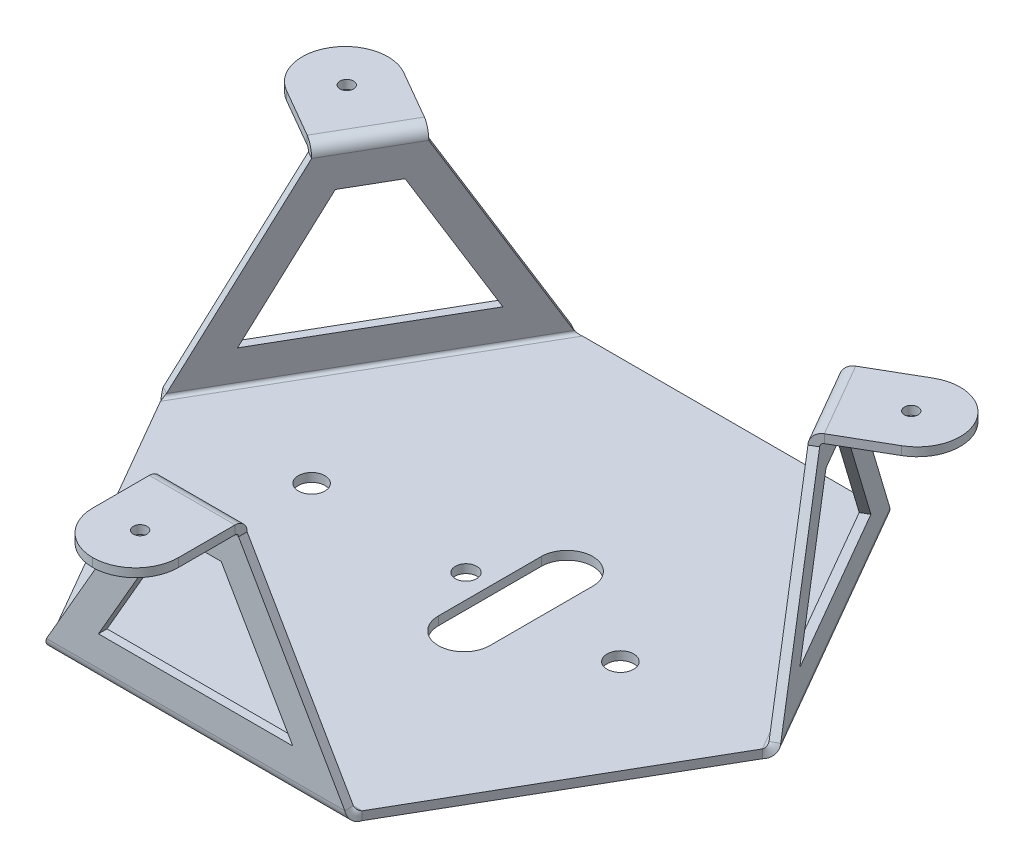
ISO-10303-21;
HEADER;
FILE_DESCRIPTION(('STEP AP214'),'2;1');
FILE_NAME('part.step','',(''),(''),'','','');
FILE_SCHEMA(('AUTOMOTIVE_DESIGN { 1 0 10303 214 1 1 1 1 }'));
ENDSEC;
DATA;
#1=APPLICATION_CONTEXT('core data for automotive mechanical design processes');
#2=APPLICATION_PROTOCOL_DEFINITION('international standard','automotive_design',2000,#1);
#3=PRODUCT_CONTEXT('',#1,'mechanical');
#4=PRODUCT('Part','Part','',(#3));
#5=PRODUCT_RELATED_PRODUCT_CATEGORY('part','',(#4));
#6=PRODUCT_DEFINITION_FORMATION('','',#4);
#7=PRODUCT_DEFINITION_CONTEXT('part definition',#1,'design');
#8=PRODUCT_DEFINITION('design','',#6,#7);
#9=PRODUCT_DEFINITION_SHAPE('','',#8);
#10=(LENGTH_UNIT() NAMED_UNIT(*) SI_UNIT(.MILLI.,.METRE.));
#11=(NAMED_UNIT(*) PLANE_ANGLE_UNIT() SI_UNIT($,.RADIAN.));
#12=(NAMED_UNIT(*) SI_UNIT($,.STERADIAN.) SOLID_ANGLE_UNIT());
#13=UNCERTAINTY_MEASURE_WITH_UNIT(LENGTH_MEASURE(1.E-05),#10,'distance_accuracy_value','');
#14=(GEOMETRIC_REPRESENTATION_CONTEXT(3) GLOBAL_UNCERTAINTY_ASSIGNED_CONTEXT((#13)) GLOBAL_UNIT_ASSIGNED_CONTEXT((#10,
#11,#12)) REPRESENTATION_CONTEXT('',''));
#15=CARTESIAN_POINT('',(0.,0.,0.));
#16=DIRECTION('',(0.,0.,1.));
#17=DIRECTION('',(1.,0.,0.));
#18=AXIS2_PLACEMENT_3D('',#15,#16,#17);
#19=CARTESIAN_POINT('',(96.2108379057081,59.5933619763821,-105.045980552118));
#20=DIRECTION('',(-0.866017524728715,0.,-0.500013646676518));
#21=DIRECTION('',(0.500013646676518,0.,-0.866017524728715));
#22=AXIS2_PLACEMENT_3D('',#19,#20,#21);
#23=PLANE('',#22);
#24=DIRECTION('',(-0.500013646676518,0.,0.866017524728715));
#25=VECTOR('',#24,1.);
#26=CARTESIAN_POINT('',(96.2108379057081,61.5933619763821,-105.045980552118));
#27=LINE('',#26,#25);
#28=CARTESIAN_POINT('',(70.187066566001,61.593361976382,-59.9731266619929));
#29=VERTEX_POINT('',#28);
#30=CARTESIAN_POINT('',(36.0222026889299,61.5933619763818,-0.800000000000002));
#31=VERTEX_POINT('',#30);
#32=EDGE_CURVE('E1196',#29,#31,#27,.T.);
#33=ORIENTED_EDGE('',*,*,#32,.T.);
#34=CARTESIAN_POINT('',(36.0222026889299,59.5933619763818,-0.800000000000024));
#35=CARTESIAN_POINT('',(36.0222026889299,61.5933619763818,-0.800000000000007));
#36=B_SPLINE_CURVE_WITH_KNOTS('',1,(#34,#35),.UNSPECIFIED.,.F.,.F.,(2,2),(0.,1.),.UNSPECIFIED.);
#37=CARTESIAN_POINT('',(36.0222026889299,59.5933619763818,-0.800000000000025));
#38=VERTEX_POINT('',#37);
#39=EDGE_CURVE('E810',#31,#38,#36,.F.);
#40=ORIENTED_EDGE('',*,*,#39,.T.);
#41=DIRECTION('',(-0.500013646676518,0.,0.866017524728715));
#42=VECTOR('',#41,1.);
#43=CARTESIAN_POINT('',(96.2108379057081,59.5933619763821,-105.045980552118));
#44=LINE('',#43,#42);
#45=CARTESIAN_POINT('',(70.187066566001,59.593361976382,-59.9731266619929));
#46=VERTEX_POINT('',#45);
#47=EDGE_CURVE('E1170',#46,#38,#44,.T.);
#48=ORIENTED_EDGE('',*,*,#47,.F.);
#49=CARTESIAN_POINT('',(70.187066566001,61.593361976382,-59.9731266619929));
#50=CARTESIAN_POINT('',(70.187066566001,59.593361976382,-59.9731266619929));
#51=B_SPLINE_CURVE_WITH_KNOTS('',1,(#49,#50),.UNSPECIFIED.,.F.,.F.,(2,2),(0.,1.),.UNSPECIFIED.);
#52=EDGE_CURVE('E1578',#29,#46,#51,.T.);
#53=ORIENTED_EDGE('',*,*,#52,.F.);
#54=EDGE_LOOP('',(#33,#40,#48,#53));
#55=FACE_BOUND('',#54,.T.);
#56=ADVANCED_FACE('F148',(#55),#23,.F.);
#57=CARTESIAN_POINT('',(-10.0015686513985,59.5933619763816,44.2728538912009));
#58=DIRECTION('',(0.866033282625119,0.,-0.499986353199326));
#59=DIRECTION('',(0.499986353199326,0.,0.866033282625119));
#60=AXIS2_PLACEMENT_3D('',#57,#58,#59);
#61=PLANE('',#60);
#62=DIRECTION('',(-0.499986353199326,0.,-0.866033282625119));
#63=VECTOR('',#62,1.);
#64=CARTESIAN_POINT('',(-10.0015686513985,59.5933619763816,44.2728538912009));
#65=LINE('',#64,#63);
#66=CARTESIAN_POINT('',(-36.0234459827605,59.5933619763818,-0.800000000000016));
#67=VERTEX_POINT('',#66);
#68=CARTESIAN_POINT('',(-70.1871003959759,59.593361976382,-59.9753386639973));
#69=VERTEX_POINT('',#68);
#70=EDGE_CURVE('E1171',#67,#69,#65,.T.);
#71=ORIENTED_EDGE('',*,*,#70,.F.);
#72=CARTESIAN_POINT('',(-36.0234459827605,61.5933619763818,-0.800000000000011));
#73=CARTESIAN_POINT('',(-36.0234459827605,59.5933619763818,-0.800000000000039));
#74=B_SPLINE_CURVE_WITH_KNOTS('',1,(#72,#73),.UNSPECIFIED.,.F.,.F.,(2,2),(0.,1.),.UNSPECIFIED.);
#75=CARTESIAN_POINT('',(-36.0234459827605,61.5933619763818,-0.800000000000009));
#76=VERTEX_POINT('',#75);
#77=EDGE_CURVE('E1270',#67,#76,#74,.F.);
#78=ORIENTED_EDGE('',*,*,#77,.T.);
#79=DIRECTION('',(-0.499986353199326,0.,-0.866033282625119));
#80=VECTOR('',#79,1.);
#81=CARTESIAN_POINT('',(-10.0015686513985,61.5933619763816,44.2728538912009));
#82=LINE('',#81,#80);
#83=CARTESIAN_POINT('',(-70.1871003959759,61.593361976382,-59.9753386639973));
#84=VERTEX_POINT('',#83);
#85=EDGE_CURVE('E1164',#76,#84,#82,.T.);
#86=ORIENTED_EDGE('',*,*,#85,.T.);
#87=CARTESIAN_POINT('',(-70.187100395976,59.593361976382,-59.9753386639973));
#88=CARTESIAN_POINT('',(-70.187100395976,61.593361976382,-59.9753386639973));
#89=B_SPLINE_CURVE_WITH_KNOTS('',1,(#87,#88),.UNSPECIFIED.,.F.,.F.,(2,2),(0.,1.),.UNSPECIFIED.);
#90=EDGE_CURVE('E1462',#69,#84,#89,.T.);
#91=ORIENTED_EDGE('',*,*,#90,.F.);
#92=EDGE_LOOP('',(#71,#78,#86,#91));
#93=FACE_BOUND('',#92,.T.);
#94=ADVANCED_FACE('F1236',(#93),#61,.F.);
#95=CARTESIAN_POINT('',(182.413832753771,61.5933619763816,44.2728538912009));
#96=DIRECTION('',(0.,-1.,0.));
#97=DIRECTION('',(1.,0.,0.));
#98=AXIS2_PLACEMENT_3D('',#95,#96,#97);
#99=PLANE('',#98);
#100=DIRECTION('',(0.,0.,1.));
#101=VECTOR('',#100,1.);
#102=CARTESIAN_POINT('',(17.55,61.5933619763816,44.2728538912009));
#103=LINE('',#102,#101);
#104=CARTESIAN_POINT('',(17.55,61.5933619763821,-73.04765419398));
#105=VERTEX_POINT('',#104);
#106=CARTESIAN_POINT('',(17.55,61.593361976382,-49.04765419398));
#107=VERTEX_POINT('',#106);
#108=EDGE_CURVE('E586',#105,#107,#103,.T.);
#109=ORIENTED_EDGE('',*,*,#108,.T.);
#110=CARTESIAN_POINT('',(11.55,61.5933619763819,-49.04765419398));
#111=DIRECTION('',(0.,-1.,0.));
#112=DIRECTION('',(0.,0.,-1.));
#113=AXIS2_PLACEMENT_3D('',#110,#111,#112);
#114=CIRCLE('',#113,6.);
#115=CARTESIAN_POINT('',(5.55000000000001,61.593361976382,-49.04765419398));
#116=VERTEX_POINT('',#115);
#117=EDGE_CURVE('E589',#107,#116,#114,.T.);
#118=ORIENTED_EDGE('',*,*,#117,.T.);
#119=DIRECTION('',(0.,0.,-1.));
#120=VECTOR('',#119,1.);
#121=CARTESIAN_POINT('',(5.55,61.5933619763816,44.2728538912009));
#122=LINE('',#121,#120);
#123=CARTESIAN_POINT('',(5.55,61.593361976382,-73.04765419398));
#124=VERTEX_POINT('',#123);
#125=EDGE_CURVE('E574',#116,#124,#122,.T.);
#126=ORIENTED_EDGE('',*,*,#125,.T.);
#127=CARTESIAN_POINT('',(11.55,61.593361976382,-73.04765419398));
#128=DIRECTION('',(0.,-1.,0.));
#129=DIRECTION('',(0.,0.,-1.));
#130=AXIS2_PLACEMENT_3D('',#127,#128,#129);
#131=CIRCLE('',#130,6.);
#132=EDGE_CURVE('E583',#124,#105,#131,.T.);
#133=ORIENTED_EDGE('',*,*,#132,.T.);
#134=EDGE_LOOP('',(#109,#118,#126,#133));
#135=FACE_BOUND('',#134,.T.);
#136=CARTESIAN_POINT('',(36.,61.593361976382,-61.0476541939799));
#137=DIRECTION('',(0.,-1.,0.));
#138=DIRECTION('',(1.,0.,0.));
#139=AXIS2_PLACEMENT_3D('',#136,#137,#138);
#140=CIRCLE('',#139,3.1);
#141=CARTESIAN_POINT('',(39.1,61.593361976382,-61.0476541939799));
#142=VERTEX_POINT('',#141);
#143=EDGE_CURVE('E1152',#142,#142,#140,.T.);
#144=ORIENTED_EDGE('',*,*,#143,.T.);
#145=EDGE_LOOP('',(#144));
#146=FACE_BOUND('',#145,.T.);
#147=CARTESIAN_POINT('',(0.,61.593361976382,-61.04765419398));
#148=DIRECTION('',(0.,-1.,0.));
#149=DIRECTION('',(1.,0.,0.));
#150=AXIS2_PLACEMENT_3D('',#147,#148,#149);
#151=CIRCLE('',#150,2.5);
#152=CARTESIAN_POINT('',(2.50000000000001,61.593361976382,-61.04765419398));
#153=VERTEX_POINT('',#152);
#154=EDGE_CURVE('E1158',#153,#153,#151,.T.);
#155=ORIENTED_EDGE('',*,*,#154,.T.);
#156=EDGE_LOOP('',(#155));
#157=FACE_BOUND('',#156,.T.);
#158=CARTESIAN_POINT('',(-36.,61.593361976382,-61.04765419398));
#159=DIRECTION('',(0.,-1.,0.));
#160=DIRECTION('',(1.,0.,0.));
#161=AXIS2_PLACEMENT_3D('',#158,#159,#160);
#162=CIRCLE('',#161,3.1);
#163=CARTESIAN_POINT('',(-32.9,61.593361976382,-61.04765419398));
#164=VERTEX_POINT('',#163);
#165=EDGE_CURVE('E1151',#164,#164,#162,.T.);
#166=ORIENTED_EDGE('',*,*,#165,.T.);
#167=EDGE_LOOP('',(#166));
#168=FACE_BOUND('',#167,.T.);
#169=ORIENTED_EDGE('',*,*,#85,.F.);
#170=DIRECTION('',(1.,0.,0.));
#171=VECTOR('',#170,1.);
#172=CARTESIAN_POINT('',(182.413832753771,61.5933619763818,-0.800000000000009));
#173=LINE('',#172,#171);
#174=EDGE_CURVE('E1619',#76,#31,#173,.T.);
#175=ORIENTED_EDGE('',*,*,#174,.T.);
#176=ORIENTED_EDGE('',*,*,#32,.F.);
#177=DIRECTION('',(0.499972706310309,0.,0.86604116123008));
#178=VECTOR('',#177,1.);
#179=CARTESIAN_POINT('',(143.378886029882,61.5933619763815,66.8080506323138));
#180=LINE('',#179,#178);
#181=CARTESIAN_POINT('',(34.1662086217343,61.5933619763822,-122.367623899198));
#182=VERTEX_POINT('',#181);
#183=EDGE_CURVE('E1579',#182,#29,#180,.T.);
#184=ORIENTED_EDGE('',*,*,#183,.F.);
#185=DIRECTION('',(0.999999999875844,0.,1.57578964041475E-05));
#186=VECTOR('',#185,1.);
#187=CARTESIAN_POINT('',(-86.2094512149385,61.5933619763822,-122.369520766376));
#188=LINE('',#187,#186);
#189=CARTESIAN_POINT('',(-34.1642760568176,61.5933619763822,-122.368700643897));
#190=VERTEX_POINT('',#189);
#191=EDGE_CURVE('E1492',#190,#182,#188,.T.);
#192=ORIENTED_EDGE('',*,*,#191,.F.);
#193=DIRECTION('',(0.500000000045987,0.,-0.866025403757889));
#194=VECTOR('',#193,1.);
#195=CARTESIAN_POINT('',(-52.1776586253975,61.5933619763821,-91.1686068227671));
#196=LINE('',#195,#194);
#197=EDGE_CURVE('E1481',#84,#190,#196,.T.);
#198=ORIENTED_EDGE('',*,*,#197,.F.);
#199=EDGE_LOOP('',(#169,#175,#176,#184,#192,#198));
#200=FACE_BOUND('',#199,.T.);
#201=ADVANCED_FACE('F1242',(#135,#146,#157,#168,#200),#99,.F.);
#202=CARTESIAN_POINT('',(182.413832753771,59.5933619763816,44.2728538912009));
#203=DIRECTION('',(0.,-1.,0.));
#204=DIRECTION('',(1.,0.,0.));
#205=AXIS2_PLACEMENT_3D('',#202,#203,#204);
#206=PLANE('',#205);
#207=CARTESIAN_POINT('',(11.55,59.593361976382,-49.04765419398));
#208=DIRECTION('',(0.,-1.,0.));
#209=DIRECTION('',(0.,0.,-1.));
#210=AXIS2_PLACEMENT_3D('',#207,#208,#209);
#211=CIRCLE('',#210,6.);
#212=CARTESIAN_POINT('',(17.55,59.5933619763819,-49.04765419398));
#213=VERTEX_POINT('',#212);
#214=CARTESIAN_POINT('',(5.55,59.593361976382,-49.0476541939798));
#215=VERTEX_POINT('',#214);
#216=EDGE_CURVE('E554',#213,#215,#211,.T.);
#217=ORIENTED_EDGE('',*,*,#216,.F.);
#218=DIRECTION('',(0.,0.,1.));
#219=VECTOR('',#218,1.);
#220=CARTESIAN_POINT('',(17.55,59.5933619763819,-49.04765419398));
#221=LINE('',#220,#219);
#222=CARTESIAN_POINT('',(17.55,59.593361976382,-73.04765419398));
#223=VERTEX_POINT('',#222);
#224=EDGE_CURVE('E568',#223,#213,#221,.T.);
#225=ORIENTED_EDGE('',*,*,#224,.F.);
#226=CARTESIAN_POINT('',(11.55,59.593361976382,-73.04765419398));
#227=DIRECTION('',(0.,-1.,0.));
#228=DIRECTION('',(0.,0.,-1.));
#229=AXIS2_PLACEMENT_3D('',#226,#227,#228);
#230=CIRCLE('',#229,6.);
#231=CARTESIAN_POINT('',(5.55,59.593361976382,-73.04765419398));
#232=VERTEX_POINT('',#231);
#233=EDGE_CURVE('E565',#232,#223,#230,.T.);
#234=ORIENTED_EDGE('',*,*,#233,.F.);
#235=DIRECTION('',(0.,0.,-1.));
#236=VECTOR('',#235,1.);
#237=CARTESIAN_POINT('',(5.55000000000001,59.593361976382,-49.04765419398));
#238=LINE('',#237,#236);
#239=EDGE_CURVE('E562',#215,#232,#238,.T.);
#240=ORIENTED_EDGE('',*,*,#239,.F.);
#241=EDGE_LOOP('',(#217,#225,#234,#240));
#242=FACE_BOUND('',#241,.T.);
#243=DIRECTION('',(1.,0.,0.));
#244=VECTOR('',#243,1.);
#245=CARTESIAN_POINT('',(182.413832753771,59.5933619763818,-0.800000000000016));
#246=LINE('',#245,#244);
#247=EDGE_CURVE('E1191',#67,#38,#246,.T.);
#248=ORIENTED_EDGE('',*,*,#247,.F.);
#249=ORIENTED_EDGE('',*,*,#70,.T.);
#250=DIRECTION('',(0.500000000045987,0.,-0.866025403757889));
#251=VECTOR('',#250,1.);
#252=CARTESIAN_POINT('',(-52.1776586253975,59.5933619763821,-91.1686068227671));
#253=LINE('',#252,#251);
#254=CARTESIAN_POINT('',(-34.1642760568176,59.5933619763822,-122.368700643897));
#255=VERTEX_POINT('',#254);
#256=EDGE_CURVE('E1172',#69,#255,#253,.T.);
#257=ORIENTED_EDGE('',*,*,#256,.T.);
#258=DIRECTION('',(0.999999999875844,0.,1.57578964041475E-05));
#259=VECTOR('',#258,1.);
#260=CARTESIAN_POINT('',(-86.2094512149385,59.5933619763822,-122.369520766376));
#261=LINE('',#260,#259);
#262=CARTESIAN_POINT('',(34.1662086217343,59.5933619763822,-122.367623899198));
#263=VERTEX_POINT('',#262);
#264=EDGE_CURVE('E1167',#255,#263,#261,.T.);
#265=ORIENTED_EDGE('',*,*,#264,.T.);
#266=DIRECTION('',(0.499972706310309,0.,0.86604116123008));
#267=VECTOR('',#266,1.);
#268=CARTESIAN_POINT('',(143.378886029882,59.5933619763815,66.8080506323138));
#269=LINE('',#268,#267);
#270=EDGE_CURVE('E1182',#263,#46,#269,.T.);
#271=ORIENTED_EDGE('',*,*,#270,.T.);
#272=ORIENTED_EDGE('',*,*,#47,.T.);
#273=EDGE_LOOP('',(#248,#249,#257,#265,#271,#272));
#274=FACE_BOUND('',#273,.T.);
#275=CARTESIAN_POINT('',(-36.,59.593361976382,-61.04765419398));
#276=DIRECTION('',(0.,-1.,0.));
#277=DIRECTION('',(1.,0.,0.));
#278=AXIS2_PLACEMENT_3D('',#275,#276,#277);
#279=CIRCLE('',#278,3.1);
#280=CARTESIAN_POINT('',(-32.9,59.593361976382,-61.04765419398));
#281=VERTEX_POINT('',#280);
#282=EDGE_CURVE('E1155',#281,#281,#279,.T.);
#283=ORIENTED_EDGE('',*,*,#282,.F.);
#284=EDGE_LOOP('',(#283));
#285=FACE_BOUND('',#284,.T.);
#286=CARTESIAN_POINT('',(0.,59.593361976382,-61.04765419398));
#287=DIRECTION('',(0.,-1.,0.));
#288=DIRECTION('',(1.,0.,0.));
#289=AXIS2_PLACEMENT_3D('',#286,#287,#288);
#290=CIRCLE('',#289,2.5);
#291=CARTESIAN_POINT('',(2.50000000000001,59.593361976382,-61.04765419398));
#292=VERTEX_POINT('',#291);
#293=EDGE_CURVE('E1161',#292,#292,#290,.T.);
#294=ORIENTED_EDGE('',*,*,#293,.F.);
#295=EDGE_LOOP('',(#294));
#296=FACE_BOUND('',#295,.T.);
#297=CARTESIAN_POINT('',(36.,59.593361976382,-61.04765419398));
#298=DIRECTION('',(0.,-1.,0.));
#299=DIRECTION('',(1.,0.,0.));
#300=AXIS2_PLACEMENT_3D('',#297,#298,#299);
#301=CIRCLE('',#300,3.1);
#302=CARTESIAN_POINT('',(39.1,59.593361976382,-61.04765419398));
#303=VERTEX_POINT('',#302);
#304=EDGE_CURVE('E1143',#303,#303,#301,.T.);
#305=ORIENTED_EDGE('',*,*,#304,.F.);
#306=EDGE_LOOP('',(#305));
#307=FACE_BOUND('',#306,.T.);
#308=ADVANCED_FACE('F1247',(#242,#274,#285,#296,#307),#206,.T.);
#309=CARTESIAN_POINT('',(-86.2094512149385,59.5933619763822,-122.369520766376));
#310=DIRECTION('',(-1.57578964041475E-05,0.,0.999999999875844));
#311=DIRECTION('',(-0.999999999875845,0.,-1.57578964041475E-05));
#312=AXIS2_PLACEMENT_3D('',#309,#310,#311);
#313=PLANE('',#312);
#314=CARTESIAN_POINT('',(34.1662086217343,59.5933619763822,-122.367623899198));
#315=CARTESIAN_POINT('',(34.1662086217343,61.5933619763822,-122.367623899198));
#316=B_SPLINE_CURVE_WITH_KNOTS('',1,(#314,#315),.UNSPECIFIED.,.F.,.F.,(2,2),(0.,1.),.UNSPECIFIED.);
#317=EDGE_CURVE('E1554',#263,#182,#316,.T.);
#318=ORIENTED_EDGE('',*,*,#317,.F.);
#319=ORIENTED_EDGE('',*,*,#264,.F.);
#320=CARTESIAN_POINT('',(-34.1642760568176,61.5933619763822,-122.368700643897));
#321=CARTESIAN_POINT('',(-34.1642760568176,59.5933619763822,-122.368700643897));
#322=B_SPLINE_CURVE_WITH_KNOTS('',1,(#320,#321),.UNSPECIFIED.,.F.,.F.,(2,2),(0.,1.),.UNSPECIFIED.);
#323=EDGE_CURVE('E1483',#190,#255,#322,.T.);
#324=ORIENTED_EDGE('',*,*,#323,.F.);
#325=ORIENTED_EDGE('',*,*,#191,.T.);
#326=EDGE_LOOP('',(#318,#319,#324,#325));
#327=FACE_BOUND('',#326,.T.);
#328=ADVANCED_FACE('F1591',(#327),#313,.F.);
#329=CARTESIAN_POINT('',(0.,59.593361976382,-61.04765419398));
#330=DIRECTION('',(0.,1.,0.));
#331=DIRECTION('',(-1.,0.,0.));
#332=AXIS2_PLACEMENT_3D('',#329,#330,#331);
#333=CYLINDRICAL_SURFACE('',#332,2.5);
#334=ORIENTED_EDGE('',*,*,#293,.T.);
#335=EDGE_LOOP('',(#334));
#336=FACE_BOUND('',#335,.T.);
#337=ORIENTED_EDGE('',*,*,#154,.F.);
#338=EDGE_LOOP('',(#337));
#339=FACE_BOUND('',#338,.T.);
#340=ADVANCED_FACE('F1600',(#336,#339),#333,.F.);
#341=CARTESIAN_POINT('',(-36.,59.593361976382,-61.04765419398));
#342=DIRECTION('',(0.,1.,0.));
#343=DIRECTION('',(-1.,0.,0.));
#344=AXIS2_PLACEMENT_3D('',#341,#342,#343);
#345=CYLINDRICAL_SURFACE('',#344,3.1);
#346=ORIENTED_EDGE('',*,*,#282,.T.);
#347=EDGE_LOOP('',(#346));
#348=FACE_BOUND('',#347,.T.);
#349=ORIENTED_EDGE('',*,*,#165,.F.);
#350=EDGE_LOOP('',(#349));
#351=FACE_BOUND('',#350,.T.);
#352=ADVANCED_FACE('F1603',(#348,#351),#345,.F.);
#353=CARTESIAN_POINT('',(36.,59.593361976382,-61.04765419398));
#354=DIRECTION('',(0.,1.,0.));
#355=DIRECTION('',(-1.,0.,0.));
#356=AXIS2_PLACEMENT_3D('',#353,#354,#355);
#357=CYLINDRICAL_SURFACE('',#356,3.1);
#358=ORIENTED_EDGE('',*,*,#304,.T.);
#359=EDGE_LOOP('',(#358));
#360=FACE_BOUND('',#359,.T.);
#361=ORIENTED_EDGE('',*,*,#143,.F.);
#362=EDGE_LOOP('',(#361));
#363=FACE_BOUND('',#362,.T.);
#364=ADVANCED_FACE('F1115',(#360,#363),#357,.F.);
#365=CARTESIAN_POINT('',(-70.187100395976,59.593361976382,-59.9753386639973));
#366=CARTESIAN_POINT('',(-70.4529400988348,59.593361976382,-60.2480515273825));
#367=CARTESIAN_POINT('',(-70.7185661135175,59.6662384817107,-60.5206011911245));
#368=CARTESIAN_POINT('',(-71.2018331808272,59.9467600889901,-61.0380362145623));
#369=CARTESIAN_POINT('',(-71.4191990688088,60.1542948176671,-61.2827427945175));
#370=CARTESIAN_POINT('',(-71.7648523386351,60.6726311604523,-61.7207264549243));
#371=CARTESIAN_POINT('',(-71.8929631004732,60.9832288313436,-61.9139015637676));
#372=CARTESIAN_POINT('',(-72.0326627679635,61.6604679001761,-62.2329778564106));
#373=CARTESIAN_POINT('',(-72.0441647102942,62.0267816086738,-62.3588089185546));
#374=CARTESIAN_POINT('',(-71.9925365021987,62.3933619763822,-62.4482315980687));
#375=CARTESIAN_POINT('',(-70.187100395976,61.593361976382,-59.9753386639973));
#376=CARTESIAN_POINT('',(-70.2261743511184,61.593361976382,-60.1171192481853));
#377=CARTESIAN_POINT('',(-70.2652054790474,61.6141838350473,-60.2588533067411));
#378=CARTESIAN_POINT('',(-70.3295395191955,61.6943328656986,-60.5344172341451));
#379=CARTESIAN_POINT('',(-70.3547729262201,61.7536285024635,-60.668196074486));
#380=CARTESIAN_POINT('',(-70.3797887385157,61.9017246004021,-60.9210596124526));
#381=CARTESIAN_POINT('',(-70.3795206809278,61.9904667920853,-61.0401151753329));
#382=CARTESIAN_POINT('',(-70.3456926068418,62.1839636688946,-61.2590051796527));
#383=CARTESIAN_POINT('',(-70.3121099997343,62.2886326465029,-61.3588156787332));
#384=CARTESIAN_POINT('',(-70.2604856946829,62.393361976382,-61.4482315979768));
#385=B_SPLINE_SURFACE_WITH_KNOTS('',1,3,((#365,#366,#367,#368,#369,#370,#371,#372,#373,#374),
(#375,#376,#377,#378,#379,#380,#381,#382,#383,#384)),.UNSPECIFIED.,.F.,.F.,.F.,(2,2),(4,2,2,2,
4),(0.,1.),(0.,0.25,0.5,0.75,1.),.UNSPECIFIED.);
#386=CARTESIAN_POINT('',(-70.187100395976,61.593361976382,-59.9753386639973));
#387=CARTESIAN_POINT('',(-70.2261743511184,61.593361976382,-60.1171192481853));
#388=CARTESIAN_POINT('',(-70.2652054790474,61.6141838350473,-60.2588533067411));
#389=CARTESIAN_POINT('',(-70.3295395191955,61.6943328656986,-60.5344172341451));
#390=CARTESIAN_POINT('',(-70.3547729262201,61.7536285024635,-60.668196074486));
#391=CARTESIAN_POINT('',(-70.3797887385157,61.9017246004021,-60.9210596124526));
#392=CARTESIAN_POINT('',(-70.3795206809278,61.9904667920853,-61.0401151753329));
#393=CARTESIAN_POINT('',(-70.3456926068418,62.1839636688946,-61.2590051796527));
#394=CARTESIAN_POINT('',(-70.3121099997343,62.2886326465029,-61.3588156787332));
#395=CARTESIAN_POINT('',(-70.2604856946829,62.393361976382,-61.4482315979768));
#396=B_SPLINE_CURVE_WITH_KNOTS('',3,(#386,#387,#388,#389,#390,#391,#392,#393,#394,#395),
.UNSPECIFIED.,.F.,.F.,(4,2,2,2,4),(0.,0.25,0.5,0.75,1.),.UNSPECIFIED.);
#397=CARTESIAN_POINT('',(-70.2604856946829,62.393361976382,-61.4482315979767));
#398=VERTEX_POINT('',#397);
#399=EDGE_CURVE('E1020',#84,#398,#396,.T.);
#400=CARTESIAN_POINT('',(-70.2604856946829,62.393361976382,-61.4482315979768));
#401=CARTESIAN_POINT('',(-71.9925365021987,62.3933619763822,-62.4482315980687));
#402=B_SPLINE_CURVE_WITH_KNOTS('',1,(#400,#401),.UNSPECIFIED.,.F.,.F.,(2,2),(0.,1.),.UNSPECIFIED.);
#403=CARTESIAN_POINT('',(-71.9925365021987,62.393361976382,-62.4482315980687));
#404=VERTEX_POINT('',#403);
#405=EDGE_CURVE('E1203',#404,#398,#402,.F.);
#406=CARTESIAN_POINT('',(-71.9925365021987,62.3933619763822,-62.4482315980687));
#407=CARTESIAN_POINT('',(-72.0441647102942,62.0267816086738,-62.3588089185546));
#408=CARTESIAN_POINT('',(-72.0326627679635,61.6604679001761,-62.2329778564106));
#409=CARTESIAN_POINT('',(-71.8929631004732,60.9832288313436,-61.9139015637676));
#410=CARTESIAN_POINT('',(-71.7648523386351,60.6726311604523,-61.7207264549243));
#411=CARTESIAN_POINT('',(-71.4191990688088,60.1542948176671,-61.2827427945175));
#412=CARTESIAN_POINT('',(-71.2018331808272,59.9467600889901,-61.0380362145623));
#413=CARTESIAN_POINT('',(-70.7185661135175,59.6662384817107,-60.5206011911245));
#414=CARTESIAN_POINT('',(-70.4529400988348,59.593361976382,-60.2480515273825));
#415=CARTESIAN_POINT('',(-70.187100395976,59.593361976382,-59.9753386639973));
#416=B_SPLINE_CURVE_WITH_KNOTS('',3,(#406,#407,#408,#409,#410,#411,#412,#413,#414,#415),
.UNSPECIFIED.,.F.,.F.,(4,2,2,2,4),(0.,0.25,0.5,0.75,1.),.UNSPECIFIED.);
#417=EDGE_CURVE('E1450',#69,#404,#416,.F.);
#418=ORIENTED_EDGE('',*,*,#90,.T.);
#419=ORIENTED_EDGE('',*,*,#399,.T.);
#420=ORIENTED_EDGE('',*,*,#405,.F.);
#421=ORIENTED_EDGE('',*,*,#417,.F.);
#422=EDGE_LOOP('',(#418,#419,#420,#421));
#423=FACE_BOUND('',#422,.T.);
#424=ADVANCED_FACE('F1052',(#423),#385,.T.);
#425=CARTESIAN_POINT('',(-37.2085371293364,62.3933619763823,-122.695885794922));
#426=CARTESIAN_POINT('',(-37.1569126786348,62.0267816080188,-122.785301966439));
#427=CARTESIAN_POINT('',(-37.0421925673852,61.6604679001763,-122.838250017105));
#428=CARTESIAN_POINT('',(-36.6960220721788,60.9832288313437,-122.876791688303));
#429=CARTESIAN_POINT('',(-36.4646758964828,60.6726311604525,-122.86242556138));
#430=CARTESIAN_POINT('',(-35.9125517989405,60.1542948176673,-122.782059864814));
#431=CARTESIAN_POINT('',(-35.5919504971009,59.9467600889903,-122.71616226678));
#432=CARTESIAN_POINT('',(-34.9022126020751,59.6662384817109,-122.556345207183));
#433=CARTESIAN_POINT('',(-34.5333684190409,59.5933619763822,-122.462574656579));
#434=CARTESIAN_POINT('',(-34.1642760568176,59.5933619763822,-122.368700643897));
#435=CARTESIAN_POINT('',(-35.4764863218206,62.3933619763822,-121.69588579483));
#436=CARTESIAN_POINT('',(-35.4248657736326,62.2886326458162,-121.785295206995));
#437=CARTESIAN_POINT('',(-35.3552224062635,62.1839636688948,-121.864277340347));
#438=CARTESIAN_POINT('',(-35.1825796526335,61.9904667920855,-122.003005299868));
#439=CARTESIAN_POINT('',(-35.0796122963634,61.9017246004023,-122.062758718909));
#440=CARTESIAN_POINT('',(-34.8481256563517,61.7536285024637,-122.167513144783));
#441=CARTESIAN_POINT('',(-34.7196568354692,61.6943328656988,-122.212543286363));
#442=CARTESIAN_POINT('',(-34.4488519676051,61.6141838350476,-122.2945973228));
#443=CARTESIAN_POINT('',(-34.3065948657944,61.5933619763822,-122.33165589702));
#444=CARTESIAN_POINT('',(-34.1642760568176,61.5933619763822,-122.368700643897));
#445=B_SPLINE_SURFACE_WITH_KNOTS('',1,3,((#425,#426,#427,#428,#429,#430,#431,#432,#433,#434),
(#435,#436,#437,#438,#439,#440,#441,#442,#443,#444)),.UNSPECIFIED.,.F.,.F.,.F.,(2,2),(4,2,2,2,
4),(0.,1.),(0.,0.25,0.5,0.75,1.),.UNSPECIFIED.);
#446=CARTESIAN_POINT('',(-35.4764863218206,62.3933619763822,-121.69588579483));
#447=CARTESIAN_POINT('',(-35.4248657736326,62.2886326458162,-121.785295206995));
#448=CARTESIAN_POINT('',(-35.3552224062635,62.1839636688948,-121.864277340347));
#449=CARTESIAN_POINT('',(-35.1825796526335,61.9904667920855,-122.003005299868));
#450=CARTESIAN_POINT('',(-35.0796122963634,61.9017246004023,-122.062758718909));
#451=CARTESIAN_POINT('',(-34.8481256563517,61.7536285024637,-122.167513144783));
#452=CARTESIAN_POINT('',(-34.7196568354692,61.6943328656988,-122.212543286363));
#453=CARTESIAN_POINT('',(-34.4488519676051,61.6141838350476,-122.2945973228));
#454=CARTESIAN_POINT('',(-34.3065948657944,61.5933619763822,-122.33165589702));
#455=CARTESIAN_POINT('',(-34.1642760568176,61.5933619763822,-122.368700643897));
#456=B_SPLINE_CURVE_WITH_KNOTS('',3,(#446,#447,#448,#449,#450,#451,#452,#453,#454,#455),
.UNSPECIFIED.,.F.,.F.,(4,2,2,2,4),(0.,0.25,0.5,0.75,1.),.UNSPECIFIED.);
#457=CARTESIAN_POINT('',(-35.4764863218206,62.3933619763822,-121.69588579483));
#458=VERTEX_POINT('',#457);
#459=EDGE_CURVE('E1084',#458,#190,#456,.T.);
#460=CARTESIAN_POINT('',(-34.1642760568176,59.5933619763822,-122.368700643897));
#461=CARTESIAN_POINT('',(-34.5333684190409,59.5933619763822,-122.462574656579));
#462=CARTESIAN_POINT('',(-34.9022126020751,59.6662384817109,-122.556345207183));
#463=CARTESIAN_POINT('',(-35.5919504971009,59.9467600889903,-122.71616226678));
#464=CARTESIAN_POINT('',(-35.9125517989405,60.1542948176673,-122.782059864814));
#465=CARTESIAN_POINT('',(-36.4646758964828,60.6726311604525,-122.86242556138));
#466=CARTESIAN_POINT('',(-36.6960220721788,60.9832288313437,-122.876791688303));
#467=CARTESIAN_POINT('',(-37.0421925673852,61.6604679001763,-122.838250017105));
#468=CARTESIAN_POINT('',(-37.1569126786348,62.0267816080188,-122.785301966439));
#469=CARTESIAN_POINT('',(-37.2085371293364,62.3933619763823,-122.695885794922));
#470=B_SPLINE_CURVE_WITH_KNOTS('',3,(#460,#461,#462,#463,#464,#465,#466,#467,#468,#469),
.UNSPECIFIED.,.F.,.F.,(4,2,2,2,4),(0.,0.25,0.5,0.75,1.),.UNSPECIFIED.);
#471=CARTESIAN_POINT('',(-37.2085371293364,62.3933619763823,-122.695885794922));
#472=VERTEX_POINT('',#471);
#473=EDGE_CURVE('E1077',#472,#255,#470,.F.);
#474=CARTESIAN_POINT('',(-37.2085371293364,62.3933619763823,-122.695885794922));
#475=CARTESIAN_POINT('',(-35.4764863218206,62.3933619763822,-121.69588579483));
#476=B_SPLINE_CURVE_WITH_KNOTS('',1,(#474,#475),.UNSPECIFIED.,.F.,.F.,(2,2),(0.,1.),.UNSPECIFIED.);
#477=EDGE_CURVE('E1021',#458,#472,#476,.F.);
#478=ORIENTED_EDGE('',*,*,#459,.T.);
#479=ORIENTED_EDGE('',*,*,#323,.T.);
#480=ORIENTED_EDGE('',*,*,#473,.F.);
#481=ORIENTED_EDGE('',*,*,#477,.F.);
#482=EDGE_LOOP('',(#478,#479,#480,#481));
#483=FACE_BOUND('',#482,.T.);
#484=ADVANCED_FACE('F1050',(#483),#445,.T.);
#485=CARTESIAN_POINT('',(-88.5259472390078,62.3933619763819,-28.2115241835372));
#486=DIRECTION('',(0.500000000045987,0.,-0.866025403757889));
#487=DIRECTION('',(0.866025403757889,0.,0.500000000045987));
#488=AXIS2_PLACEMENT_3D('',#485,#486,#487);
#489=CYLINDRICAL_SURFACE('',#488,2.8);
#490=DIRECTION('',(0.500000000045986,0.,-0.866025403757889));
#491=VECTOR('',#490,1.);
#492=CARTESIAN_POINT('',(-54.6025297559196,62.3933619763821,-92.5686068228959));
#493=LINE('',#492,#491);
#494=EDGE_CURVE('E1032',#404,#472,#493,.T.);
#495=ORIENTED_EDGE('',*,*,#494,.T.);
#496=ORIENTED_EDGE('',*,*,#473,.T.);
#497=ORIENTED_EDGE('',*,*,#256,.F.);
#498=ORIENTED_EDGE('',*,*,#417,.T.);
#499=EDGE_LOOP('',(#495,#496,#497,#498));
#500=FACE_BOUND('',#499,.T.);
#501=ADVANCED_FACE('F1039',(#500),#489,.T.);
#502=CARTESIAN_POINT('',(-88.5259472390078,62.3933619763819,-28.2115241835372));
#503=DIRECTION('',(0.500000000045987,0.,-0.866025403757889));
#504=DIRECTION('',(0.866025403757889,0.,0.500000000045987));
#505=AXIS2_PLACEMENT_3D('',#502,#503,#504);
#506=CYLINDRICAL_SURFACE('',#505,0.8);
#507=DIRECTION('',(0.500000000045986,0.,-0.866025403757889));
#508=VECTOR('',#507,1.);
#509=CARTESIAN_POINT('',(-52.8704789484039,62.3933619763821,-91.5686068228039));
#510=LINE('',#509,#508);
#511=EDGE_CURVE('E1220',#398,#458,#510,.T.);
#512=ORIENTED_EDGE('',*,*,#511,.F.);
#513=ORIENTED_EDGE('',*,*,#399,.F.);
#514=ORIENTED_EDGE('',*,*,#197,.T.);
#515=ORIENTED_EDGE('',*,*,#459,.F.);
#516=EDGE_LOOP('',(#512,#513,#514,#515));
#517=FACE_BOUND('',#516,.T.);
#518=ADVANCED_FACE('F1049',(#517),#506,.F.);
#519=CARTESIAN_POINT('',(-54.6025297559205,-210.635267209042,-92.5686068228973));
#520=DIRECTION('',(-0.866025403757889,0.,-0.500000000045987));
#521=DIRECTION('',(0.250000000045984,-0.866025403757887,-0.433012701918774));
#522=AXIS2_PLACEMENT_3D('',#519,#520,#521);
#523=PLANE('',#522);
#524=DIRECTION('',(0.249993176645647,-0.866033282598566,-0.433000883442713));
#525=VECTOR('',#524,1.);
#526=CARTESIAN_POINT('',(-51.6208485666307,98.3205080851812,-97.733030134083));
#527=LINE('',#526,#525);
#528=CARTESIAN_POINT('',(-51.6208485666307,98.3205080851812,-97.733030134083));
#529=VERTEX_POINT('',#528);
#530=CARTESIAN_POINT('',(-43.2706046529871,69.3933619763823,-112.196076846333));
#531=VERTEX_POINT('',#530);
#532=EDGE_CURVE('E165',#529,#531,#527,.T.);
#533=ORIENTED_EDGE('',*,*,#532,.F.);
#534=DIRECTION('',(0.500000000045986,0.,-0.866025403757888));
#535=VECTOR('',#534,1.);
#536=CARTESIAN_POINT('',(-57.5793966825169,98.3205080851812,-87.41252205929));
#537=LINE('',#536,#535);
#538=CARTESIAN_POINT('',(-57.5793966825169,98.3205080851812,-87.41252205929));
#539=VERTEX_POINT('',#538);
#540=EDGE_CURVE('E478',#539,#529,#537,.T.);
#541=ORIENTED_EDGE('',*,*,#540,.F.);
#542=DIRECTION('',(0.250006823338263,0.866017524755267,-0.433024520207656));
#543=VECTOR('',#542,1.);
#544=CARTESIAN_POINT('',(-65.9302483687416,69.3933619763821,-72.9484226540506));
#545=LINE('',#544,#543);
#546=CARTESIAN_POINT('',(-65.9302483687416,69.3933619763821,-72.9484226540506));
#547=VERTEX_POINT('',#546);
#548=EDGE_CURVE('E481',#547,#539,#545,.T.);
#549=ORIENTED_EDGE('',*,*,#548,.F.);
#550=DIRECTION('',(-0.500000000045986,0.,0.866025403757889));
#551=VECTOR('',#550,1.);
#552=CARTESIAN_POINT('',(-43.2706046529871,69.3933619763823,-112.196076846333));
#553=LINE('',#552,#551);
#554=EDGE_CURVE('E487',#531,#547,#553,.T.);
#555=ORIENTED_EDGE('',*,*,#554,.F.);
#556=EDGE_LOOP('',(#533,#541,#549,#555));
#557=FACE_BOUND('',#556,.T.);
#558=ORIENTED_EDGE('',*,*,#494,.F.);
#559=DIRECTION('',(0.250006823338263,0.866017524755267,-0.433024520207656));
#560=VECTOR('',#559,1.);
#561=CARTESIAN_POINT('',(-102.706380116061,-43.998641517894,-9.25029396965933));
#562=LINE('',#561,#560);
#563=CARTESIAN_POINT('',(-59.6000858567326,105.320508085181,-83.912585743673));
#564=VERTEX_POINT('',#563);
#565=EDGE_CURVE('E1025',#404,#564,#562,.T.);
#566=ORIENTED_EDGE('',*,*,#565,.T.);
#567=DIRECTION('',(0.500000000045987,0.,-0.866025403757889));
#568=VECTOR('',#567,1.);
#569=CARTESIAN_POINT('',(-59.6000858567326,105.320508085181,-83.912585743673));
#570=LINE('',#569,#568);
#571=CARTESIAN_POINT('',(-49.6000858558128,105.320508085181,-101.233093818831));
#572=VERTEX_POINT('',#571);
#573=EDGE_CURVE('E1022',#564,#572,#570,.T.);
#574=ORIENTED_EDGE('',*,*,#573,.T.);
#575=DIRECTION('',(0.249993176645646,-0.866033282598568,-0.433000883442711));
#576=VECTOR('',#575,1.);
#577=CARTESIAN_POINT('',(-49.6000858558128,105.320508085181,-101.233093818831));
#578=LINE('',#577,#576);
#579=EDGE_CURVE('E1024',#572,#472,#578,.T.);
#580=ORIENTED_EDGE('',*,*,#579,.T.);
#581=EDGE_LOOP('',(#558,#566,#574,#580));
#582=FACE_BOUND('',#581,.T.);
#583=ADVANCED_FACE('F984',(#557,#582),#523,.T.);
#584=CARTESIAN_POINT('',(-102.706380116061,-43.998641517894,-9.25029396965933));
#585=DIRECTION('',(0.433008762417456,-0.500013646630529,-0.749993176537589));
#586=DIRECTION('',(-0.250006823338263,-0.866017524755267,0.433024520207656));
#587=AXIS2_PLACEMENT_3D('',#584,#585,#586);
#588=PLANE('',#587);
#589=ORIENTED_EDGE('',*,*,#565,.F.);
#590=ORIENTED_EDGE('',*,*,#405,.T.);
#591=DIRECTION('',(0.250006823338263,0.866017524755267,-0.433024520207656));
#592=VECTOR('',#591,1.);
#593=CARTESIAN_POINT('',(-100.974329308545,-43.998641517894,-8.25029396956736));
#594=LINE('',#593,#592);
#595=CARTESIAN_POINT('',(-57.8680350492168,105.320508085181,-82.9125857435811));
#596=VERTEX_POINT('',#595);
#597=EDGE_CURVE('E1433',#398,#596,#594,.T.);
#598=ORIENTED_EDGE('',*,*,#597,.T.);
#599=DIRECTION('',(0.866025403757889,0.,0.500000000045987));
#600=VECTOR('',#599,1.);
#601=CARTESIAN_POINT('',(-59.6000858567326,105.320508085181,-83.912585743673));
#602=LINE('',#601,#600);
#603=EDGE_CURVE('E1026',#564,#596,#602,.T.);
#604=ORIENTED_EDGE('',*,*,#603,.F.);
#605=EDGE_LOOP('',(#589,#590,#598,#604));
#606=FACE_BOUND('',#605,.T.);
#607=ADVANCED_FACE('F1222',(#606),#588,.F.);
#608=CARTESIAN_POINT('',(-52.8704789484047,-210.635267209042,-91.5686068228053));
#609=DIRECTION('',(-0.866025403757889,0.,-0.500000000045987));
#610=DIRECTION('',(0.250000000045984,-0.866025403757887,-0.433012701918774));
#611=AXIS2_PLACEMENT_3D('',#608,#609,#610);
#612=PLANE('',#611);
#613=DIRECTION('',(0.500000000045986,0.,-0.866025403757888));
#614=VECTOR('',#613,1.);
#615=CARTESIAN_POINT('',(-55.8473458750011,98.3205080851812,-86.412522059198));
#616=LINE('',#615,#614);
#617=CARTESIAN_POINT('',(-55.8473458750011,98.3205080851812,-86.412522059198));
#618=VERTEX_POINT('',#617);
#619=CARTESIAN_POINT('',(-49.8887977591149,98.3205080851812,-96.7330301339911));
#620=VERTEX_POINT('',#619);
#621=EDGE_CURVE('E468',#618,#620,#616,.T.);
#622=ORIENTED_EDGE('',*,*,#621,.T.);
#623=DIRECTION('',(0.249993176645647,-0.866033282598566,-0.433000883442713));
#624=VECTOR('',#623,1.);
#625=CARTESIAN_POINT('',(-49.8887977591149,98.3205080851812,-96.7330301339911));
#626=LINE('',#625,#624);
#627=CARTESIAN_POINT('',(-41.5385538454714,69.3933619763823,-111.196076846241));
#628=VERTEX_POINT('',#627);
#629=EDGE_CURVE('E462',#620,#628,#626,.T.);
#630=ORIENTED_EDGE('',*,*,#629,.T.);
#631=DIRECTION('',(-0.500000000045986,0.,0.866025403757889));
#632=VECTOR('',#631,1.);
#633=CARTESIAN_POINT('',(-41.5385538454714,69.3933619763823,-111.196076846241));
#634=LINE('',#633,#632);
#635=CARTESIAN_POINT('',(-64.1981975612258,69.3933619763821,-71.9484226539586));
#636=VERTEX_POINT('',#635);
#637=EDGE_CURVE('E471',#628,#636,#634,.T.);
#638=ORIENTED_EDGE('',*,*,#637,.T.);
#639=DIRECTION('',(0.250006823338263,0.866017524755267,-0.433024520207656));
#640=VECTOR('',#639,1.);
#641=CARTESIAN_POINT('',(-64.1981975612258,69.3933619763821,-71.9484226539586));
#642=LINE('',#641,#640);
#643=EDGE_CURVE('E173',#636,#618,#642,.T.);
#644=ORIENTED_EDGE('',*,*,#643,.T.);
#645=EDGE_LOOP('',(#622,#630,#638,#644));
#646=FACE_BOUND('',#645,.T.);
#647=ORIENTED_EDGE('',*,*,#597,.F.);
#648=ORIENTED_EDGE('',*,*,#511,.T.);
#649=DIRECTION('',(0.249993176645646,-0.866033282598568,-0.433000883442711));
#650=VECTOR('',#649,1.);
#651=CARTESIAN_POINT('',(-47.8680350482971,105.320508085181,-100.233093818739));
#652=LINE('',#651,#650);
#653=CARTESIAN_POINT('',(-47.8680350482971,105.320508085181,-100.233093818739));
#654=VERTEX_POINT('',#653);
#655=EDGE_CURVE('E1430',#654,#458,#652,.T.);
#656=ORIENTED_EDGE('',*,*,#655,.F.);
#657=DIRECTION('',(0.500000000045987,0.,-0.866025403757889));
#658=VECTOR('',#657,1.);
#659=CARTESIAN_POINT('',(-57.8680350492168,105.320508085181,-82.9125857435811));
#660=LINE('',#659,#658);
#661=EDGE_CURVE('E1029',#596,#654,#660,.T.);
#662=ORIENTED_EDGE('',*,*,#661,.F.);
#663=EDGE_LOOP('',(#647,#648,#656,#662));
#664=FACE_BOUND('',#663,.T.);
#665=ADVANCED_FACE('F475',(#646,#664),#612,.F.);
#666=CARTESIAN_POINT('',(-49.6000858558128,105.320508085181,-101.233093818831));
#667=DIRECTION('',(-0.433016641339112,-0.499986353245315,0.750006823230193));
#668=DIRECTION('',(-0.249993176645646,0.866033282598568,0.433000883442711));
#669=AXIS2_PLACEMENT_3D('',#666,#667,#668);
#670=PLANE('',#669);
#671=ORIENTED_EDGE('',*,*,#655,.T.);
#672=ORIENTED_EDGE('',*,*,#477,.T.);
#673=ORIENTED_EDGE('',*,*,#579,.F.);
#674=DIRECTION('',(0.866025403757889,0.,0.500000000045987));
#675=VECTOR('',#674,1.);
#676=CARTESIAN_POINT('',(-49.6000858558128,105.320508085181,-101.233093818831));
#677=LINE('',#676,#675);
#678=EDGE_CURVE('E1012',#572,#654,#677,.T.);
#679=ORIENTED_EDGE('',*,*,#678,.T.);
#680=EDGE_LOOP('',(#671,#672,#673,#679));
#681=FACE_BOUND('',#680,.T.);
#682=ADVANCED_FACE('F1053',(#681),#670,.F.);
#683=CARTESIAN_POINT('',(34.1662086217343,59.5933619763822,-122.367623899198));
#684=CARTESIAN_POINT('',(34.535303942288,59.5933619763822,-122.461486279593));
#685=CARTESIAN_POINT('',(34.9041510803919,59.6662384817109,-122.555245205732));
#686=CARTESIAN_POINT('',(35.5938940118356,59.9467600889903,-122.715040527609));
#687=CARTESIAN_POINT('',(35.9144973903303,60.1542948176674,-122.780928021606));
#688=CARTESIAN_POINT('',(36.4666240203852,60.6726311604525,-122.861276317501));
#689=CARTESIAN_POINT('',(36.697970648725,60.9832288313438,-122.875635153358));
#690=CARTESIAN_POINT('',(37.0441399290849,61.6604679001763,-122.837082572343));
#691=CARTESIAN_POINT('',(37.1588583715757,62.0267816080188,-122.784130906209));
#692=CARTESIAN_POINT('',(37.2104800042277,62.3933619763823,-122.694713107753));
#693=CARTESIAN_POINT('',(34.1662086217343,61.5933619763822,-122.367623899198));
#694=CARTESIAN_POINT('',(34.308526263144,61.5933619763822,-122.33057466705));
#695=CARTESIAN_POINT('',(34.4507821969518,61.6141838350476,-122.293511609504));
#696=CARTESIAN_POINT('',(34.7215844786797,61.6943328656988,-122.211449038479));
#697=CARTESIAN_POINT('',(34.8500518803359,61.7536285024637,-122.166414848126));
#698=CARTESIAN_POINT('',(35.0815352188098,61.9017246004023,-122.06165312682));
#699=CARTESIAN_POINT('',(35.1845006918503,61.9904667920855,-122.001896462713));
#700=CARTESIAN_POINT('',(35.3571390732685,62.1839636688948,-121.86316306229));
#701=CARTESIAN_POINT('',(35.4267799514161,62.2886326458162,-121.784178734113));
#702=CARTESIAN_POINT('',(35.4783976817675,62.3933619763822,-121.694767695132));
#703=B_SPLINE_SURFACE_WITH_KNOTS('',1,3,((#683,#684,#685,#686,#687,#688,#689,#690,#691,#692),
(#693,#694,#695,#696,#697,#698,#699,#700,#701,#702)),.UNSPECIFIED.,.F.,.F.,.F.,(2,2),(4,2,2,2,
4),(0.,1.),(0.,0.25,0.5,0.75,1.),.UNSPECIFIED.);
#704=CARTESIAN_POINT('',(34.1662086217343,61.5933619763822,-122.367623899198));
#705=CARTESIAN_POINT('',(34.308526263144,61.5933619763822,-122.33057466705));
#706=CARTESIAN_POINT('',(34.4507821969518,61.6141838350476,-122.293511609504));
#707=CARTESIAN_POINT('',(34.7215844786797,61.6943328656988,-122.211449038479));
#708=CARTESIAN_POINT('',(34.8500518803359,61.7536285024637,-122.166414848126));
#709=CARTESIAN_POINT('',(35.0815352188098,61.9017246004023,-122.06165312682));
#710=CARTESIAN_POINT('',(35.1845006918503,61.9904667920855,-122.001896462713));
#711=CARTESIAN_POINT('',(35.3571390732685,62.1839636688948,-121.86316306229));
#712=CARTESIAN_POINT('',(35.4267799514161,62.2886326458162,-121.784178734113));
#713=CARTESIAN_POINT('',(35.4783976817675,62.3933619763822,-121.694767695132));
#714=B_SPLINE_CURVE_WITH_KNOTS('',3,(#704,#705,#706,#707,#708,#709,#710,#711,#712,#713),
.UNSPECIFIED.,.F.,.F.,(4,2,2,2,4),(0.,0.25,0.5,0.75,1.),.UNSPECIFIED.);
#715=CARTESIAN_POINT('',(35.4783976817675,62.3933619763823,-121.694767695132));
#716=VERTEX_POINT('',#715);
#717=EDGE_CURVE('E889',#182,#716,#714,.T.);
#718=CARTESIAN_POINT('',(35.4783976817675,62.3933619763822,-121.694767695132));
#719=CARTESIAN_POINT('',(37.2104800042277,62.3933619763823,-122.694713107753));
#720=B_SPLINE_CURVE_WITH_KNOTS('',1,(#718,#719),.UNSPECIFIED.,.F.,.F.,(2,2),(0.,1.),.UNSPECIFIED.);
#721=CARTESIAN_POINT('',(37.2104800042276,62.3933619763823,-122.694713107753));
#722=VERTEX_POINT('',#721);
#723=EDGE_CURVE('E1517',#722,#716,#720,.F.);
#724=CARTESIAN_POINT('',(37.2104800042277,62.3933619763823,-122.694713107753));
#725=CARTESIAN_POINT('',(37.1588583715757,62.0267816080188,-122.784130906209));
#726=CARTESIAN_POINT('',(37.0441399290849,61.6604679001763,-122.837082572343));
#727=CARTESIAN_POINT('',(36.697970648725,60.9832288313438,-122.875635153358));
#728=CARTESIAN_POINT('',(36.4666240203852,60.6726311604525,-122.861276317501));
#729=CARTESIAN_POINT('',(35.9144973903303,60.1542948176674,-122.780928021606));
#730=CARTESIAN_POINT('',(35.5938940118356,59.9467600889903,-122.715040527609));
#731=CARTESIAN_POINT('',(34.9041510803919,59.6662384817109,-122.555245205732));
#732=CARTESIAN_POINT('',(34.535303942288,59.5933619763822,-122.461486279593));
#733=CARTESIAN_POINT('',(34.1662086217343,59.5933619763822,-122.367623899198));
#734=B_SPLINE_CURVE_WITH_KNOTS('',3,(#724,#725,#726,#727,#728,#729,#730,#731,#732,#733),
.UNSPECIFIED.,.F.,.F.,(4,2,2,2,4),(0.,0.25,0.5,0.75,1.),.UNSPECIFIED.);
#735=EDGE_CURVE('E1566',#263,#722,#734,.F.);
#736=ORIENTED_EDGE('',*,*,#317,.T.);
#737=ORIENTED_EDGE('',*,*,#717,.T.);
#738=ORIENTED_EDGE('',*,*,#723,.F.);
#739=ORIENTED_EDGE('',*,*,#735,.F.);
#740=EDGE_LOOP('',(#736,#737,#738,#739));
#741=FACE_BOUND('',#740,.T.);
#742=ADVANCED_FACE('F921',(#741),#703,.T.);
#743=CARTESIAN_POINT('',(71.9925806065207,62.3933619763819,-62.4459626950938));
#744=CARTESIAN_POINT('',(72.0442059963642,62.0267816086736,-62.3565383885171));
#745=CARTESIAN_POINT('',(72.0327000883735,61.660467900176,-62.2307076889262));
#746=CARTESIAN_POINT('',(71.8929903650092,60.9832288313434,-61.9116357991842));
#747=CARTESIAN_POINT('',(71.7648735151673,60.6726311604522,-61.7184647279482));
#748=CARTESIAN_POINT('',(71.4192064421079,60.1542948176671,-61.2804919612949));
#749=CARTESIAN_POINT('',(71.201832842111,59.9467600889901,-61.0357922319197));
#750=CARTESIAN_POINT('',(70.718549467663,59.6662384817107,-60.5183724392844));
#751=CARTESIAN_POINT('',(70.4529148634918,59.593361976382,-60.245831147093));
#752=CARTESIAN_POINT('',(70.187066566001,59.593361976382,-59.9731266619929));
#753=CARTESIAN_POINT('',(70.2604982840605,62.393361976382,-61.4460172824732));
#754=CARTESIAN_POINT('',(70.3121197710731,62.2886326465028,-61.3565997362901));
#755=CARTESIAN_POINT('',(70.3456992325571,62.1839636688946,-61.2567881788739));
#756=CARTESIAN_POINT('',(70.3795204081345,61.9904667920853,-61.037897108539));
#757=CARTESIAN_POINT('',(70.3797847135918,61.9017246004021,-60.9188415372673));
#758=CARTESIAN_POINT('',(70.3547609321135,61.7536285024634,-60.6659787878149));
#759=CARTESIAN_POINT('',(70.3295233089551,61.6943328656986,-60.5322007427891));
#760=CARTESIAN_POINT('',(70.2651805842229,61.6141838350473,-60.2566388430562));
#761=CARTESIAN_POINT('',(70.2261449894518,61.593361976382,-60.1149060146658));
#762=CARTESIAN_POINT('',(70.187066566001,61.593361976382,-59.9731266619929));
#763=B_SPLINE_SURFACE_WITH_KNOTS('',1,3,((#743,#744,#745,#746,#747,#748,#749,#750,#751,#752),
(#753,#754,#755,#756,#757,#758,#759,#760,#761,#762)),.UNSPECIFIED.,.F.,.F.,.F.,(2,2),(4,2,2,2,
4),(0.,1.),(0.,0.25,0.5,0.75,1.),.UNSPECIFIED.);
#764=CARTESIAN_POINT('',(70.2604982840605,62.393361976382,-61.4460172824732));
#765=CARTESIAN_POINT('',(70.3121197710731,62.2886326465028,-61.3565997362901));
#766=CARTESIAN_POINT('',(70.3456992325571,62.1839636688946,-61.2567881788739));
#767=CARTESIAN_POINT('',(70.3795204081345,61.9904667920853,-61.037897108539));
#768=CARTESIAN_POINT('',(70.3797847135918,61.9017246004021,-60.9188415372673));
#769=CARTESIAN_POINT('',(70.3547609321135,61.7536285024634,-60.6659787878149));
#770=CARTESIAN_POINT('',(70.3295233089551,61.6943328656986,-60.5322007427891));
#771=CARTESIAN_POINT('',(70.2651805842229,61.6141838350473,-60.2566388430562));
#772=CARTESIAN_POINT('',(70.2261449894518,61.593361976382,-60.1149060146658));
#773=CARTESIAN_POINT('',(70.187066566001,61.593361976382,-59.9731266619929));
#774=B_SPLINE_CURVE_WITH_KNOTS('',3,(#764,#765,#766,#767,#768,#769,#770,#771,#772,#773),
.UNSPECIFIED.,.F.,.F.,(4,2,2,2,4),(0.,0.25,0.5,0.75,1.),.UNSPECIFIED.);
#775=CARTESIAN_POINT('',(70.2604982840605,62.393361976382,-61.4460172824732));
#776=VERTEX_POINT('',#775);
#777=EDGE_CURVE('E953',#776,#29,#774,.T.);
#778=CARTESIAN_POINT('',(70.187066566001,59.593361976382,-59.9731266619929));
#779=CARTESIAN_POINT('',(70.4529148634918,59.593361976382,-60.245831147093));
#780=CARTESIAN_POINT('',(70.718549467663,59.6662384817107,-60.5183724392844));
#781=CARTESIAN_POINT('',(71.201832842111,59.9467600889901,-61.0357922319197));
#782=CARTESIAN_POINT('',(71.4192064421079,60.1542948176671,-61.2804919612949));
#783=CARTESIAN_POINT('',(71.7648735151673,60.6726311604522,-61.7184647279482));
#784=CARTESIAN_POINT('',(71.8929903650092,60.9832288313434,-61.9116357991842));
#785=CARTESIAN_POINT('',(72.0327000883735,61.660467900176,-62.2307076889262));
#786=CARTESIAN_POINT('',(72.0442059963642,62.0267816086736,-62.3565383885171));
#787=CARTESIAN_POINT('',(71.9925806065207,62.3933619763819,-62.4459626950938));
#788=B_SPLINE_CURVE_WITH_KNOTS('',3,(#778,#779,#780,#781,#782,#783,#784,#785,#786,#787),
.UNSPECIFIED.,.F.,.F.,(4,2,2,2,4),(0.,0.25,0.5,0.75,1.),.UNSPECIFIED.);
#789=CARTESIAN_POINT('',(71.9925806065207,62.3933619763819,-62.4459626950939));
#790=VERTEX_POINT('',#789);
#791=EDGE_CURVE('E946',#790,#46,#788,.F.);
#792=CARTESIAN_POINT('',(71.9925806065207,62.3933619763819,-62.4459626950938));
#793=CARTESIAN_POINT('',(70.2604982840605,62.393361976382,-61.4460172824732));
#794=B_SPLINE_CURVE_WITH_KNOTS('',1,(#792,#793),.UNSPECIFIED.,.F.,.F.,(2,2),(0.,1.),.UNSPECIFIED.);
#795=EDGE_CURVE('E890',#776,#790,#794,.F.);
#796=ORIENTED_EDGE('',*,*,#777,.T.);
#797=ORIENTED_EDGE('',*,*,#52,.T.);
#798=ORIENTED_EDGE('',*,*,#791,.F.);
#799=ORIENTED_EDGE('',*,*,#795,.F.);
#800=EDGE_LOOP('',(#796,#797,#798,#799));
#801=FACE_BOUND('',#800,.T.);
#802=ADVANCED_FACE('F919',(#801),#763,.T.);
#803=CARTESIAN_POINT('',(15.828379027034,62.3933619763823,-154.131988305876));
#804=DIRECTION('',(0.499972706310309,0.,0.86604116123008));
#805=DIRECTION('',(-0.86604116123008,0.,0.499972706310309));
#806=AXIS2_PLACEMENT_3D('',#803,#804,#805);
#807=CYLINDRICAL_SURFACE('',#806,2.8);
#808=DIRECTION('',(0.499972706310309,0.,0.86604116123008));
#809=VECTOR('',#808,1.);
#810=CARTESIAN_POINT('',(145.803801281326,62.3933619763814,65.4081270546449));
#811=LINE('',#810,#809);
#812=EDGE_CURVE('E901',#722,#790,#811,.T.);
#813=ORIENTED_EDGE('',*,*,#812,.T.);
#814=ORIENTED_EDGE('',*,*,#791,.T.);
#815=ORIENTED_EDGE('',*,*,#270,.F.);
#816=ORIENTED_EDGE('',*,*,#735,.T.);
#817=EDGE_LOOP('',(#813,#814,#815,#816));
#818=FACE_BOUND('',#817,.T.);
#819=ADVANCED_FACE('F908',(#818),#807,.T.);
#820=CARTESIAN_POINT('',(15.828379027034,62.3933619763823,-154.131988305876));
#821=DIRECTION('',(0.499972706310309,0.,0.86604116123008));
#822=DIRECTION('',(-0.86604116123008,0.,0.499972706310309));
#823=AXIS2_PLACEMENT_3D('',#820,#821,#822);
#824=CYLINDRICAL_SURFACE('',#823,0.8);
#825=DIRECTION('',(0.499972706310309,0.,0.86604116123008));
#826=VECTOR('',#825,1.);
#827=CARTESIAN_POINT('',(144.071718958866,62.3933619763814,66.4080724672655));
#828=LINE('',#827,#826);
#829=EDGE_CURVE('E1512',#716,#776,#828,.T.);
#830=ORIENTED_EDGE('',*,*,#829,.F.);
#831=ORIENTED_EDGE('',*,*,#717,.F.);
#832=ORIENTED_EDGE('',*,*,#183,.T.);
#833=ORIENTED_EDGE('',*,*,#777,.F.);
#834=EDGE_LOOP('',(#830,#831,#832,#833));
#835=FACE_BOUND('',#834,.T.);
#836=ADVANCED_FACE('F918',(#835),#824,.F.);
#837=CARTESIAN_POINT('',(145.803801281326,105.320508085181,65.4081270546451));
#838=DIRECTION('',(0.86604116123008,0.,-0.499972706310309));
#839=DIRECTION('',(0.249972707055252,0.866041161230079,0.43299694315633));
#840=AXIS2_PLACEMENT_3D('',#837,#838,#839);
#841=PLANE('',#840);
#842=DIRECTION('',(0.249993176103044,-0.866017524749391,0.433032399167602));
#843=VECTOR('',#842,1.);
#844=CARTESIAN_POINT('',(57.580227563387,98.3205080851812,-87.4107073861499));
#845=LINE('',#844,#843);
#846=CARTESIAN_POINT('',(57.580227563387,98.3205080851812,-87.4107073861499));
#847=VERTEX_POINT('',#846);
#848=CARTESIAN_POINT('',(65.9306233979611,69.393361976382,-72.9463448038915));
#849=VERTEX_POINT('',#848);
#850=EDGE_CURVE('E522',#847,#849,#845,.T.);
#851=ORIENTED_EDGE('',*,*,#850,.F.);
#852=DIRECTION('',(0.499972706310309,0.,0.86604116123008));
#853=VECTOR('',#852,1.);
#854=CARTESIAN_POINT('',(51.6220047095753,98.3205080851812,-97.7314032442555));
#855=LINE('',#854,#853);
#856=CARTESIAN_POINT('',(51.6220047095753,98.3205080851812,-97.7314032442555));
#857=VERTEX_POINT('',#856);
#858=EDGE_CURVE('E533',#857,#847,#855,.T.);
#859=ORIENTED_EDGE('',*,*,#858,.F.);
#860=DIRECTION('',(0.24997953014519,0.866033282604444,0.433008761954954));
#861=VECTOR('',#860,1.);
#862=CARTESIAN_POINT('',(43.2722166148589,69.3933619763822,-112.194713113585));
#863=LINE('',#862,#861);
#864=CARTESIAN_POINT('',(43.2722166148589,69.3933619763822,-112.194713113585));
#865=VERTEX_POINT('',#864);
#866=EDGE_CURVE('E547',#865,#857,#863,.T.);
#867=ORIENTED_EDGE('',*,*,#866,.F.);
#868=DIRECTION('',(-0.499972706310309,0.,-0.86604116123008));
#869=VECTOR('',#868,1.);
#870=CARTESIAN_POINT('',(65.9306233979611,69.393361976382,-72.9463448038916));
#871=LINE('',#870,#869);
#872=EDGE_CURVE('E544',#849,#865,#871,.T.);
#873=ORIENTED_EDGE('',*,*,#872,.F.);
#874=EDGE_LOOP('',(#851,#859,#867,#873));
#875=FACE_BOUND('',#874,.T.);
#876=ORIENTED_EDGE('',*,*,#812,.F.);
#877=DIRECTION('',(0.24997953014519,0.866033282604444,0.433008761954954));
#878=VECTOR('',#877,1.);
#879=CARTESIAN_POINT('',(6.49967298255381,-44.0016736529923,-175.891262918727));
#880=LINE('',#879,#878);
#881=CARTESIAN_POINT('',(49.6013523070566,105.320508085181,-101.231530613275));
#882=VERTEX_POINT('',#881);
#883=EDGE_CURVE('E894',#722,#882,#880,.T.);
#884=ORIENTED_EDGE('',*,*,#883,.T.);
#885=DIRECTION('',(0.499972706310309,0.,0.86604116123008));
#886=VECTOR('',#885,1.);
#887=CARTESIAN_POINT('',(49.6013523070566,105.320508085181,-101.231530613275));
#888=LINE('',#887,#886);
#889=CARTESIAN_POINT('',(59.6008064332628,105.320508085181,-83.9107073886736));
#890=VERTEX_POINT('',#889);
#891=EDGE_CURVE('E891',#882,#890,#888,.T.);
#892=ORIENTED_EDGE('',*,*,#891,.T.);
#893=DIRECTION('',(0.249993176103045,-0.866017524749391,0.433032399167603));
#894=VECTOR('',#893,1.);
#895=CARTESIAN_POINT('',(59.6008064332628,105.320508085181,-83.9107073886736));
#896=LINE('',#895,#894);
#897=EDGE_CURVE('E893',#890,#790,#896,.T.);
#898=ORIENTED_EDGE('',*,*,#897,.T.);
#899=EDGE_LOOP('',(#876,#884,#892,#898));
#900=FACE_BOUND('',#899,.T.);
#901=ADVANCED_FACE('F869',(#875,#900),#841,.T.);
#902=CARTESIAN_POINT('',(6.49967298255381,-44.0016736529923,-175.891262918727));
#903=DIRECTION('',(0.432993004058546,-0.499986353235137,0.750020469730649));
#904=DIRECTION('',(-0.24997953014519,-0.866033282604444,-0.433008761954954));
#905=AXIS2_PLACEMENT_3D('',#902,#903,#904);
#906=PLANE('',#905);
#907=ORIENTED_EDGE('',*,*,#883,.F.);
#908=ORIENTED_EDGE('',*,*,#723,.T.);
#909=DIRECTION('',(0.24997953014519,0.866033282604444,0.433008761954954));
#910=VECTOR('',#909,1.);
#911=CARTESIAN_POINT('',(4.76759066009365,-44.0016736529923,-174.891317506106));
#912=LINE('',#911,#910);
#913=CARTESIAN_POINT('',(47.8692699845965,105.320508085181,-100.231585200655));
#914=VERTEX_POINT('',#913);
#915=EDGE_CURVE('E1515',#716,#914,#912,.T.);
#916=ORIENTED_EDGE('',*,*,#915,.T.);
#917=DIRECTION('',(-0.86604116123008,0.,0.499972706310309));
#918=VECTOR('',#917,1.);
#919=CARTESIAN_POINT('',(49.6013523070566,105.320508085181,-101.231530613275));
#920=LINE('',#919,#918);
#921=EDGE_CURVE('E895',#882,#914,#920,.T.);
#922=ORIENTED_EDGE('',*,*,#921,.F.);
#923=EDGE_LOOP('',(#907,#908,#916,#922));
#924=FACE_BOUND('',#923,.T.);
#925=ADVANCED_FACE('F1527',(#924),#906,.F.);
#926=CARTESIAN_POINT('',(144.071718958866,105.320508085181,66.4080724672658));
#927=DIRECTION('',(0.86604116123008,0.,-0.499972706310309));
#928=DIRECTION('',(0.249972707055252,0.866041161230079,0.43299694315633));
#929=AXIS2_PLACEMENT_3D('',#926,#927,#928);
#930=PLANE('',#929);
#931=DIRECTION('',(0.499972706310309,0.,0.86604116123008));
#932=VECTOR('',#931,1.);
#933=CARTESIAN_POINT('',(49.8899223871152,98.3205080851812,-96.7314578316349));
#934=LINE('',#933,#932);
#935=CARTESIAN_POINT('',(49.8899223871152,98.3205080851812,-96.7314578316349));
#936=VERTEX_POINT('',#935);
#937=CARTESIAN_POINT('',(55.8481452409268,98.3205080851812,-86.4107619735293));
#938=VERTEX_POINT('',#937);
#939=EDGE_CURVE('E539',#936,#938,#934,.T.);
#940=ORIENTED_EDGE('',*,*,#939,.T.);
#941=DIRECTION('',(0.249993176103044,-0.866017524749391,0.433032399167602));
#942=VECTOR('',#941,1.);
#943=CARTESIAN_POINT('',(55.8481452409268,98.3205080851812,-86.4107619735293));
#944=LINE('',#943,#942);
#945=CARTESIAN_POINT('',(64.1985410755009,69.393361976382,-71.946399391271));
#946=VERTEX_POINT('',#945);
#947=EDGE_CURVE('E529',#938,#946,#944,.T.);
#948=ORIENTED_EDGE('',*,*,#947,.T.);
#949=DIRECTION('',(-0.499972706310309,0.,-0.86604116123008));
#950=VECTOR('',#949,1.);
#951=CARTESIAN_POINT('',(64.1985410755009,69.393361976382,-71.946399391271));
#952=LINE('',#951,#950);
#953=CARTESIAN_POINT('',(41.5401342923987,69.3933619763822,-111.194767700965));
#954=VERTEX_POINT('',#953);
#955=EDGE_CURVE('E532',#946,#954,#952,.T.);
#956=ORIENTED_EDGE('',*,*,#955,.T.);
#957=DIRECTION('',(0.24997953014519,0.866033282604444,0.433008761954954));
#958=VECTOR('',#957,1.);
#959=CARTESIAN_POINT('',(41.5401342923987,69.3933619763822,-111.194767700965));
#960=LINE('',#959,#958);
#961=EDGE_CURVE('E536',#954,#936,#960,.T.);
#962=ORIENTED_EDGE('',*,*,#961,.T.);
#963=EDGE_LOOP('',(#940,#948,#956,#962));
#964=FACE_BOUND('',#963,.T.);
#965=ORIENTED_EDGE('',*,*,#915,.F.);
#966=ORIENTED_EDGE('',*,*,#829,.T.);
#967=DIRECTION('',(0.249993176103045,-0.866017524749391,0.433032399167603));
#968=VECTOR('',#967,1.);
#969=CARTESIAN_POINT('',(57.8687241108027,105.320508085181,-82.9107619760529));
#970=LINE('',#969,#968);
#971=CARTESIAN_POINT('',(57.8687241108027,105.320508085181,-82.910761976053));
#972=VERTEX_POINT('',#971);
#973=EDGE_CURVE('E1510',#972,#776,#970,.T.);
#974=ORIENTED_EDGE('',*,*,#973,.F.);
#975=DIRECTION('',(0.499972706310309,0.,0.86604116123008));
#976=VECTOR('',#975,1.);
#977=CARTESIAN_POINT('',(47.8692699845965,105.320508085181,-100.231585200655));
#978=LINE('',#977,#976);
#979=EDGE_CURVE('E898',#914,#972,#978,.T.);
#980=ORIENTED_EDGE('',*,*,#979,.F.);
#981=EDGE_LOOP('',(#965,#966,#974,#980));
#982=FACE_BOUND('',#981,.T.);
#983=ADVANCED_FACE('F1535',(#964,#982),#930,.F.);
#984=CARTESIAN_POINT('',(59.6008064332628,105.320508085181,-83.9107073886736));
#985=DIRECTION('',(-0.432985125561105,-0.500013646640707,-0.750006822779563));
#986=DIRECTION('',(-0.249993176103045,0.866017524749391,-0.433032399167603));
#987=AXIS2_PLACEMENT_3D('',#984,#985,#986);
#988=PLANE('',#987);
#989=ORIENTED_EDGE('',*,*,#973,.T.);
#990=ORIENTED_EDGE('',*,*,#795,.T.);
#991=ORIENTED_EDGE('',*,*,#897,.F.);
#992=DIRECTION('',(-0.86604116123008,0.,0.499972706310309));
#993=VECTOR('',#992,1.);
#994=CARTESIAN_POINT('',(59.6008064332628,105.320508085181,-83.9107073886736));
#995=LINE('',#994,#993);
#996=EDGE_CURVE('E886',#890,#972,#995,.T.);
#997=ORIENTED_EDGE('',*,*,#996,.T.);
#998=EDGE_LOOP('',(#989,#990,#991,#997));
#999=FACE_BOUND('',#998,.T.);
#1000=ADVANCED_FACE('F922',(#999),#988,.F.);
#1001=CARTESIAN_POINT('',(182.413832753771,105.320508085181,2.));
#1002=DIRECTION('',(0.,0.,1.));
#1003=DIRECTION('',(1.,0.,0.));
#1004=AXIS2_PLACEMENT_3D('',#1001,#1002,#1003);
#1005=PLANE('',#1004);
#1006=DIRECTION('',(-1.,0.,0.));
#1007=VECTOR('',#1006,1.);
#1008=CARTESIAN_POINT('',(5.9570530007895,98.3205080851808,2.));
#1009=LINE('',#1008,#1007);
#1010=CARTESIAN_POINT('',(5.9570530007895,98.3205080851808,2.));
#1011=VERTEX_POINT('',#1010);
#1012=CARTESIAN_POINT('',(-5.9600432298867,98.3205080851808,2.));
#1013=VERTEX_POINT('',#1012);
#1014=EDGE_CURVE('E493',#1011,#1013,#1009,.T.);
#1015=ORIENTED_EDGE('',*,*,#1014,.F.);
#1016=DIRECTION('',(-0.500013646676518,0.866017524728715,0.));
#1017=VECTOR('',#1016,1.);
#1018=CARTESIAN_POINT('',(22.6587563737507,69.3933619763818,2.));
#1019=LINE('',#1018,#1017);
#1020=CARTESIAN_POINT('',(22.6587563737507,69.3933619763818,2.));
#1021=VERTEX_POINT('',#1020);
#1022=EDGE_CURVE('E501',#1021,#1011,#1019,.T.);
#1023=ORIENTED_EDGE('',*,*,#1022,.F.);
#1024=DIRECTION('',(1.,0.,0.));
#1025=VECTOR('',#1024,1.);
#1026=CARTESIAN_POINT('',(-22.6605310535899,69.3933619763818,2.));
#1027=LINE('',#1026,#1025);
#1028=CARTESIAN_POINT('',(-22.6605310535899,69.3933619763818,2.));
#1029=VERTEX_POINT('',#1028);
#1030=EDGE_CURVE('E515',#1029,#1021,#1027,.T.);
#1031=ORIENTED_EDGE('',*,*,#1030,.F.);
#1032=DIRECTION('',(-0.499986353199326,-0.866033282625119,0.));
#1033=VECTOR('',#1032,1.);
#1034=CARTESIAN_POINT('',(-5.96004322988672,98.3205080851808,2.));
#1035=LINE('',#1034,#1033);
#1036=EDGE_CURVE('E512',#1013,#1029,#1035,.T.);
#1037=ORIENTED_EDGE('',*,*,#1036,.F.);
#1038=EDGE_LOOP('',(#1015,#1023,#1031,#1037));
#1039=FACE_BOUND('',#1038,.T.);
#1040=DIRECTION('',(-0.499986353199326,-0.866033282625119,0.));
#1041=VECTOR('',#1040,1.);
#1042=CARTESIAN_POINT('',(-10.0015686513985,105.320508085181,2.));
#1043=LINE('',#1042,#1041);
#1044=CARTESIAN_POINT('',(-10.0015686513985,105.320508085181,2.));
#1045=VERTEX_POINT('',#1044);
#1046=CARTESIAN_POINT('',(-34.784666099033,62.3933619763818,2.));
#1047=VERTEX_POINT('',#1046);
#1048=EDGE_CURVE('E830',#1045,#1047,#1043,.T.);
#1049=ORIENTED_EDGE('',*,*,#1048,.T.);
#1050=DIRECTION('',(1.,0.,0.));
#1051=VECTOR('',#1050,1.);
#1052=CARTESIAN_POINT('',(182.413832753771,62.3933619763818,2.));
#1053=LINE('',#1052,#1051);
#1054=CARTESIAN_POINT('',(34.7833326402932,62.3933619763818,2.));
#1055=VERTEX_POINT('',#1054);
#1056=EDGE_CURVE('E836',#1047,#1055,#1053,.T.);
#1057=ORIENTED_EDGE('',*,*,#1056,.T.);
#1058=DIRECTION('',(-0.500013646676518,0.866017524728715,0.));
#1059=VECTOR('',#1058,1.);
#1060=CARTESIAN_POINT('',(96.2108379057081,-43.9983263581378,2.));
#1061=LINE('',#1060,#1059);
#1062=CARTESIAN_POINT('',(9.99843134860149,105.320508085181,2.));
#1063=VERTEX_POINT('',#1062);
#1064=EDGE_CURVE('E826',#1055,#1063,#1061,.T.);
#1065=ORIENTED_EDGE('',*,*,#1064,.T.);
#1066=DIRECTION('',(-1.,0.,0.));
#1067=VECTOR('',#1066,1.);
#1068=CARTESIAN_POINT('',(-10.0015686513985,105.320508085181,2.));
#1069=LINE('',#1068,#1067);
#1070=EDGE_CURVE('E823',#1063,#1045,#1069,.T.);
#1071=ORIENTED_EDGE('',*,*,#1070,.T.);
#1072=EDGE_LOOP('',(#1049,#1057,#1065,#1071));
#1073=FACE_BOUND('',#1072,.T.);
#1074=ADVANCED_FACE('F785',(#1039,#1073),#1005,.T.);
#1075=CARTESIAN_POINT('',(96.2108379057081,-43.9983263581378,2.));
#1076=DIRECTION('',(-0.866017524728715,-0.500013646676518,0.));
#1077=DIRECTION('',(0.500013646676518,-0.866017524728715,0.));
#1078=AXIS2_PLACEMENT_3D('',#1075,#1076,#1077);
#1079=PLANE('',#1078);
#1080=CARTESIAN_POINT('',(34.7833326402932,62.3933619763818,0.));
#1081=CARTESIAN_POINT('',(34.7833326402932,62.3933619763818,2.));
#1082=B_SPLINE_CURVE_WITH_KNOTS('',1,(#1080,#1081),.UNSPECIFIED.,.F.,.F.,(2,2),(0.,1.),.UNSPECIFIED.);
#1083=CARTESIAN_POINT('',(34.7833326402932,62.3933619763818,0.));
#1084=VERTEX_POINT('',#1083);
#1085=EDGE_CURVE('E834',#1084,#1055,#1082,.T.);
#1086=ORIENTED_EDGE('',*,*,#1085,.F.);
#1087=DIRECTION('',(-0.500013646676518,0.866017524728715,0.));
#1088=VECTOR('',#1087,1.);
#1089=CARTESIAN_POINT('',(96.2108379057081,-43.9983263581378,0.));
#1090=LINE('',#1089,#1088);
#1091=CARTESIAN_POINT('',(9.99843134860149,105.320508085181,0.));
#1092=VERTEX_POINT('',#1091);
#1093=EDGE_CURVE('E822',#1084,#1092,#1090,.T.);
#1094=ORIENTED_EDGE('',*,*,#1093,.T.);
#1095=DIRECTION('',(0.,0.,-1.));
#1096=VECTOR('',#1095,1.);
#1097=CARTESIAN_POINT('',(9.99843134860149,105.320508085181,2.));
#1098=LINE('',#1097,#1096);
#1099=EDGE_CURVE('E827',#1063,#1092,#1098,.T.);
#1100=ORIENTED_EDGE('',*,*,#1099,.F.);
#1101=ORIENTED_EDGE('',*,*,#1064,.F.);
#1102=EDGE_LOOP('',(#1086,#1094,#1100,#1101));
#1103=FACE_BOUND('',#1102,.T.);
#1104=ADVANCED_FACE('F851',(#1103),#1079,.F.);
#1105=CARTESIAN_POINT('',(182.413832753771,105.320508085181,0.));
#1106=DIRECTION('',(0.,0.,1.));
#1107=DIRECTION('',(1.,0.,0.));
#1108=AXIS2_PLACEMENT_3D('',#1105,#1106,#1107);
#1109=PLANE('',#1108);
#1110=DIRECTION('',(-0.500013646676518,0.866017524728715,0.));
#1111=VECTOR('',#1110,1.);
#1112=CARTESIAN_POINT('',(22.6587563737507,69.3933619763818,0.));
#1113=LINE('',#1112,#1111);
#1114=CARTESIAN_POINT('',(22.6587563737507,69.3933619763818,0.));
#1115=VERTEX_POINT('',#1114);
#1116=CARTESIAN_POINT('',(5.9570530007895,98.3205080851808,0.));
#1117=VERTEX_POINT('',#1116);
#1118=EDGE_CURVE('E507',#1115,#1117,#1113,.T.);
#1119=ORIENTED_EDGE('',*,*,#1118,.T.);
#1120=DIRECTION('',(-1.,0.,0.));
#1121=VECTOR('',#1120,1.);
#1122=CARTESIAN_POINT('',(5.9570530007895,98.3205080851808,0.));
#1123=LINE('',#1122,#1121);
#1124=CARTESIAN_POINT('',(-5.96004322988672,98.3205080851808,0.));
#1125=VERTEX_POINT('',#1124);
#1126=EDGE_CURVE('E497',#1117,#1125,#1123,.T.);
#1127=ORIENTED_EDGE('',*,*,#1126,.T.);
#1128=DIRECTION('',(-0.499986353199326,-0.866033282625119,0.));
#1129=VECTOR('',#1128,1.);
#1130=CARTESIAN_POINT('',(-5.96004322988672,98.3205080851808,0.));
#1131=LINE('',#1130,#1129);
#1132=CARTESIAN_POINT('',(-22.6605310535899,69.3933619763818,0.));
#1133=VERTEX_POINT('',#1132);
#1134=EDGE_CURVE('E500',#1125,#1133,#1131,.T.);
#1135=ORIENTED_EDGE('',*,*,#1134,.T.);
#1136=DIRECTION('',(1.,0.,0.));
#1137=VECTOR('',#1136,1.);
#1138=CARTESIAN_POINT('',(-22.6605310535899,69.3933619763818,0.));
#1139=LINE('',#1138,#1137);
#1140=EDGE_CURVE('E504',#1133,#1115,#1139,.T.);
#1141=ORIENTED_EDGE('',*,*,#1140,.T.);
#1142=EDGE_LOOP('',(#1119,#1127,#1135,#1141));
#1143=FACE_BOUND('',#1142,.T.);
#1144=DIRECTION('',(1.,0.,0.));
#1145=VECTOR('',#1144,1.);
#1146=CARTESIAN_POINT('',(182.413832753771,62.3933619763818,0.));
#1147=LINE('',#1146,#1145);
#1148=CARTESIAN_POINT('',(-34.784666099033,62.3933619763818,0.));
#1149=VERTEX_POINT('',#1148);
#1150=EDGE_CURVE('E849',#1149,#1084,#1147,.T.);
#1151=ORIENTED_EDGE('',*,*,#1150,.F.);
#1152=DIRECTION('',(-0.499986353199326,-0.866033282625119,0.));
#1153=VECTOR('',#1152,1.);
#1154=CARTESIAN_POINT('',(-10.0015686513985,105.320508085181,0.));
#1155=LINE('',#1154,#1153);
#1156=CARTESIAN_POINT('',(-10.0015686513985,105.320508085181,0.));
#1157=VERTEX_POINT('',#1156);
#1158=EDGE_CURVE('E821',#1157,#1149,#1155,.T.);
#1159=ORIENTED_EDGE('',*,*,#1158,.F.);
#1160=DIRECTION('',(-1.,0.,0.));
#1161=VECTOR('',#1160,1.);
#1162=CARTESIAN_POINT('',(-10.0015686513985,105.320508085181,0.));
#1163=LINE('',#1162,#1161);
#1164=EDGE_CURVE('E831',#1092,#1157,#1163,.T.);
#1165=ORIENTED_EDGE('',*,*,#1164,.F.);
#1166=ORIENTED_EDGE('',*,*,#1093,.F.);
#1167=EDGE_LOOP('',(#1151,#1159,#1165,#1166));
#1168=FACE_BOUND('',#1167,.T.);
#1169=ADVANCED_FACE('F860',(#1143,#1168),#1109,.F.);
#1170=CARTESIAN_POINT('',(-10.0015686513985,105.320508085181,2.));
#1171=DIRECTION('',(0.866033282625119,-0.499986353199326,0.));
#1172=DIRECTION('',(0.499986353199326,0.866033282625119,0.));
#1173=AXIS2_PLACEMENT_3D('',#1170,#1171,#1172);
#1174=PLANE('',#1173);
#1175=CARTESIAN_POINT('',(-34.784666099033,62.3933619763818,2.));
#1176=CARTESIAN_POINT('',(-34.784666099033,62.3933619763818,0.));
#1177=B_SPLINE_CURVE_WITH_KNOTS('',1,(#1175,#1176),.UNSPECIFIED.,.F.,.F.,(2,2),(0.,1.),.UNSPECIFIED.);
#1178=EDGE_CURVE('E1629',#1047,#1149,#1177,.T.);
#1179=ORIENTED_EDGE('',*,*,#1178,.F.);
#1180=ORIENTED_EDGE('',*,*,#1048,.F.);
#1181=DIRECTION('',(0.,0.,-1.));
#1182=VECTOR('',#1181,1.);
#1183=CARTESIAN_POINT('',(-10.0015686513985,105.320508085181,2.));
#1184=LINE('',#1183,#1182);
#1185=EDGE_CURVE('E814',#1045,#1157,#1184,.T.);
#1186=ORIENTED_EDGE('',*,*,#1185,.T.);
#1187=ORIENTED_EDGE('',*,*,#1158,.T.);
#1188=EDGE_LOOP('',(#1179,#1180,#1186,#1187));
#1189=FACE_BOUND('',#1188,.T.);
#1190=ADVANCED_FACE('F863',(#1189),#1174,.F.);
#1191=CARTESIAN_POINT('',(-34.784666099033,62.3933619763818,2.));
#1192=CARTESIAN_POINT('',(-34.8879150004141,62.0267816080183,2.));
#1193=CARTESIAN_POINT('',(-34.9911294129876,61.6604679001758,1.92712349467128));
#1194=CARTESIAN_POINT('',(-35.1975927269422,60.9832288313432,1.64660188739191));
#1195=CARTESIAN_POINT('',(-35.3008243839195,60.672631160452,1.43906715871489));
#1196=CARTESIAN_POINT('',(-35.507287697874,60.1542948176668,0.920730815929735));
#1197=CARTESIAN_POINT('',(-35.6105193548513,59.9467600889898,0.610133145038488));
#1198=CARTESIAN_POINT('',(-35.8169826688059,59.6662384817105,-0.0671059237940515));
#1199=CARTESIAN_POINT('',(-35.9201970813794,59.5933619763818,-0.433419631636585));
#1200=CARTESIAN_POINT('',(-36.0234459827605,59.5933619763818,-0.800000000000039));
#1201=CARTESIAN_POINT('',(-34.784666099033,62.3933619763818,0.));
#1202=CARTESIAN_POINT('',(-34.8879071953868,62.2886326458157,0.));
#1203=CARTESIAN_POINT('',(-34.9911294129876,62.1839636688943,-0.0208218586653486));
#1204=CARTESIAN_POINT('',(-35.1975927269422,61.9904667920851,-0.100970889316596));
#1205=CARTESIAN_POINT('',(-35.3008243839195,61.9017246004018,-0.16026652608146));
#1206=CARTESIAN_POINT('',(-35.507287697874,61.7536285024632,-0.308362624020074));
#1207=CARTESIAN_POINT('',(-35.6105193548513,61.6943328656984,-0.397104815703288));
#1208=CARTESIAN_POINT('',(-35.8169826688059,61.6141838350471,-0.590601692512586));
#1209=CARTESIAN_POINT('',(-35.9202048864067,61.5933619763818,-0.695270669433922));
#1210=CARTESIAN_POINT('',(-36.0234459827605,61.5933619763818,-0.800000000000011));
#1211=B_SPLINE_SURFACE_WITH_KNOTS('',1,3,((#1191,#1192,#1193,#1194,#1195,#1196,#1197,#1198,
#1199,#1200),(#1201,#1202,#1203,#1204,#1205,#1206,#1207,#1208,#1209,#1210)),.UNSPECIFIED.,.F.,
.F.,.F.,(2,2),(4,2,2,2,4),(0.,1.),(0.,0.25,0.5,0.75,1.),.UNSPECIFIED.);
#1212=CARTESIAN_POINT('',(-34.784666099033,62.3933619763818,0.));
#1213=CARTESIAN_POINT('',(-34.8879071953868,62.2886326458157,0.));
#1214=CARTESIAN_POINT('',(-34.9911294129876,62.1839636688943,-0.0208218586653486));
#1215=CARTESIAN_POINT('',(-35.1975927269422,61.9904667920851,-0.100970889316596));
#1216=CARTESIAN_POINT('',(-35.3008243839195,61.9017246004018,-0.16026652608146));
#1217=CARTESIAN_POINT('',(-35.507287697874,61.7536285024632,-0.308362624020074));
#1218=CARTESIAN_POINT('',(-35.6105193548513,61.6943328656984,-0.397104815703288));
#1219=CARTESIAN_POINT('',(-35.8169826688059,61.6141838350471,-0.590601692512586));
#1220=CARTESIAN_POINT('',(-35.9202048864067,61.5933619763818,-0.695270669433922));
#1221=CARTESIAN_POINT('',(-36.0234459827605,61.5933619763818,-0.800000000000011));
#1222=B_SPLINE_CURVE_WITH_KNOTS('',3,(#1212,#1213,#1214,#1215,#1216,#1217,#1218,#1219,#1220,
#1221),.UNSPECIFIED.,.F.,.F.,(4,2,2,2,4),(0.,0.25,0.5,0.75,1.),.UNSPECIFIED.);
#1223=EDGE_CURVE('E695',#1149,#76,#1222,.T.);
#1224=CARTESIAN_POINT('',(-36.0234459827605,59.5933619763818,-0.800000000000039));
#1225=CARTESIAN_POINT('',(-35.9201970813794,59.5933619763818,-0.433419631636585));
#1226=CARTESIAN_POINT('',(-35.8169826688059,59.6662384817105,-0.0671059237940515));
#1227=CARTESIAN_POINT('',(-35.6105193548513,59.9467600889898,0.610133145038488));
#1228=CARTESIAN_POINT('',(-35.507287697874,60.1542948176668,0.920730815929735));
#1229=CARTESIAN_POINT('',(-35.3008243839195,60.672631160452,1.43906715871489));
#1230=CARTESIAN_POINT('',(-35.1975927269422,60.9832288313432,1.64660188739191));
#1231=CARTESIAN_POINT('',(-34.9911294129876,61.6604679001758,1.92712349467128));
#1232=CARTESIAN_POINT('',(-34.8879150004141,62.0267816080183,2.));
#1233=CARTESIAN_POINT('',(-34.784666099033,62.3933619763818,2.));
#1234=B_SPLINE_CURVE_WITH_KNOTS('',3,(#1224,#1225,#1226,#1227,#1228,#1229,#1230,#1231,#1232,
#1233),.UNSPECIFIED.,.F.,.F.,(4,2,2,2,4),(0.,0.25,0.5,0.75,1.),.UNSPECIFIED.);
#1235=EDGE_CURVE('E1641',#1047,#67,#1234,.F.);
#1236=ORIENTED_EDGE('',*,*,#1178,.T.);
#1237=ORIENTED_EDGE('',*,*,#1223,.T.);
#1238=ORIENTED_EDGE('',*,*,#77,.F.);
#1239=ORIENTED_EDGE('',*,*,#1235,.F.);
#1240=EDGE_LOOP('',(#1236,#1237,#1238,#1239));
#1241=FACE_BOUND('',#1240,.T.);
#1242=ADVANCED_FACE('F723',(#1241),#1211,.T.);
#1243=CARTESIAN_POINT('',(36.0222026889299,59.5933619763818,-0.800000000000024));
#1244=CARTESIAN_POINT('',(35.9189462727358,59.5933619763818,-0.433419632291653));
#1245=CARTESIAN_POINT('',(35.8157243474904,59.6662384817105,-0.0671059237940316));
#1246=CARTESIAN_POINT('',(35.609246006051,59.9467600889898,0.61013314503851));
#1247=CARTESIAN_POINT('',(35.5060068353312,60.1542948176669,0.920730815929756));
#1248=CARTESIAN_POINT('',(35.2995284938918,60.672631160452,1.4390671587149));
#1249=CARTESIAN_POINT('',(35.1962893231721,60.9832288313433,1.64660188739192));
#1250=CARTESIAN_POINT('',(34.9898109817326,61.6604679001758,1.92712349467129));
#1251=CARTESIAN_POINT('',(34.8865890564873,62.0267816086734,2.));
#1252=CARTESIAN_POINT('',(34.7833326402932,62.3933619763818,2.));
#1253=CARTESIAN_POINT('',(36.0222026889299,61.5933619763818,-0.800000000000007));
#1254=CARTESIAN_POINT('',(35.9189540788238,61.5933619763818,-0.695270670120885));
#1255=CARTESIAN_POINT('',(35.8157243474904,61.6141838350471,-0.59060169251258));
#1256=CARTESIAN_POINT('',(35.609246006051,61.6943328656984,-0.397104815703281));
#1257=CARTESIAN_POINT('',(35.5060068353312,61.7536285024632,-0.308362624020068));
#1258=CARTESIAN_POINT('',(35.2995284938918,61.9017246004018,-0.160266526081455));
#1259=CARTESIAN_POINT('',(35.1962893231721,61.9904667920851,-0.100970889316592));
#1260=CARTESIAN_POINT('',(34.9898109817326,62.1839636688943,-0.0208218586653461));
#1261=CARTESIAN_POINT('',(34.8865812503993,62.2886326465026,0.));
#1262=CARTESIAN_POINT('',(34.7833326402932,62.3933619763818,0.));
#1263=B_SPLINE_SURFACE_WITH_KNOTS('',1,3,((#1243,#1244,#1245,#1246,#1247,#1248,#1249,#1250,
#1251,#1252),(#1253,#1254,#1255,#1256,#1257,#1258,#1259,#1260,#1261,#1262)),.UNSPECIFIED.,.F.,
.F.,.F.,(2,2),(4,2,2,2,4),(0.,1.),(0.,0.25,0.5,0.75,1.),.UNSPECIFIED.);
#1264=CARTESIAN_POINT('',(36.0222026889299,61.5933619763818,-0.800000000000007));
#1265=CARTESIAN_POINT('',(35.9189540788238,61.5933619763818,-0.695270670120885));
#1266=CARTESIAN_POINT('',(35.8157243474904,61.6141838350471,-0.59060169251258));
#1267=CARTESIAN_POINT('',(35.609246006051,61.6943328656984,-0.397104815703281));
#1268=CARTESIAN_POINT('',(35.5060068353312,61.7536285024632,-0.308362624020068));
#1269=CARTESIAN_POINT('',(35.2995284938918,61.9017246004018,-0.160266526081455));
#1270=CARTESIAN_POINT('',(35.1962893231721,61.9904667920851,-0.100970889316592));
#1271=CARTESIAN_POINT('',(34.9898109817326,62.1839636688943,-0.0208218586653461));
#1272=CARTESIAN_POINT('',(34.8865812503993,62.2886326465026,0.));
#1273=CARTESIAN_POINT('',(34.7833326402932,62.3933619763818,0.));
#1274=B_SPLINE_CURVE_WITH_KNOTS('',3,(#1264,#1265,#1266,#1267,#1268,#1269,#1270,#1271,#1272,
#1273),.UNSPECIFIED.,.F.,.F.,(4,2,2,2,4),(0.,0.25,0.5,0.75,1.),.UNSPECIFIED.);
#1275=EDGE_CURVE('E754',#31,#1084,#1274,.T.);
#1276=CARTESIAN_POINT('',(34.7833326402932,62.3933619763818,2.));
#1277=CARTESIAN_POINT('',(34.8865890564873,62.0267816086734,2.));
#1278=CARTESIAN_POINT('',(34.9898109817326,61.6604679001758,1.92712349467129));
#1279=CARTESIAN_POINT('',(35.1962893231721,60.9832288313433,1.64660188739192));
#1280=CARTESIAN_POINT('',(35.2995284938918,60.672631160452,1.4390671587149));
#1281=CARTESIAN_POINT('',(35.5060068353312,60.1542948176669,0.920730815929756));
#1282=CARTESIAN_POINT('',(35.609246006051,59.9467600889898,0.61013314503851));
#1283=CARTESIAN_POINT('',(35.8157243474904,59.6662384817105,-0.0671059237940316));
#1284=CARTESIAN_POINT('',(35.9189462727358,59.5933619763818,-0.433419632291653));
#1285=CARTESIAN_POINT('',(36.0222026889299,59.5933619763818,-0.800000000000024));
#1286=B_SPLINE_CURVE_WITH_KNOTS('',3,(#1276,#1277,#1278,#1279,#1280,#1281,#1282,#1283,#1284,
#1285),.UNSPECIFIED.,.F.,.F.,(4,2,2,2,4),(0.,0.25,0.5,0.75,1.),.UNSPECIFIED.);
#1287=EDGE_CURVE('E747',#38,#1055,#1286,.F.);
#1288=ORIENTED_EDGE('',*,*,#1275,.T.);
#1289=ORIENTED_EDGE('',*,*,#1085,.T.);
#1290=ORIENTED_EDGE('',*,*,#1287,.F.);
#1291=ORIENTED_EDGE('',*,*,#39,.F.);
#1292=EDGE_LOOP('',(#1288,#1289,#1290,#1291));
#1293=FACE_BOUND('',#1292,.T.);
#1294=ADVANCED_FACE('F721',(#1293),#1263,.T.);
#1295=CARTESIAN_POINT('',(-72.106003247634,62.3933619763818,-0.8));
#1296=DIRECTION('',(1.,0.,0.));
#1297=DIRECTION('',(0.,1.,0.));
#1298=AXIS2_PLACEMENT_3D('',#1295,#1296,#1297);
#1299=CYLINDRICAL_SURFACE('',#1298,2.8);
#1300=ORIENTED_EDGE('',*,*,#247,.T.);
#1301=ORIENTED_EDGE('',*,*,#1287,.T.);
#1302=ORIENTED_EDGE('',*,*,#1056,.F.);
#1303=ORIENTED_EDGE('',*,*,#1235,.T.);
#1304=EDGE_LOOP('',(#1300,#1301,#1302,#1303));
#1305=FACE_BOUND('',#1304,.T.);
#1306=ADVANCED_FACE('F710',(#1305),#1299,.T.);
#1307=CARTESIAN_POINT('',(-72.106003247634,62.3933619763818,-0.8));
#1308=DIRECTION('',(1.,0.,0.));
#1309=DIRECTION('',(0.,1.,0.));
#1310=AXIS2_PLACEMENT_3D('',#1307,#1308,#1309);
#1311=CYLINDRICAL_SURFACE('',#1310,0.8);
#1312=ORIENTED_EDGE('',*,*,#174,.F.);
#1313=ORIENTED_EDGE('',*,*,#1223,.F.);
#1314=ORIENTED_EDGE('',*,*,#1150,.T.);
#1315=ORIENTED_EDGE('',*,*,#1275,.F.);
#1316=EDGE_LOOP('',(#1312,#1313,#1314,#1315));
#1317=FACE_BOUND('',#1316,.T.);
#1318=ADVANCED_FACE('F720',(#1317),#1311,.F.);
#1319=CARTESIAN_POINT('',(9.99843134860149,105.320508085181,2.8));
#1320=DIRECTION('',(1.,0.,0.));
#1321=DIRECTION('',(0.,0.,-1.));
#1322=AXIS2_PLACEMENT_3D('',#1319,#1320,#1321);
#1323=PLANE('',#1322);
#1324=DIRECTION('',(0.,-1.,0.));
#1325=VECTOR('',#1324,1.);
#1326=CARTESIAN_POINT('',(9.99843134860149,108.120508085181,2.79999999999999));
#1327=LINE('',#1326,#1325);
#1328=CARTESIAN_POINT('',(9.99843134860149,106.120508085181,2.8));
#1329=VERTEX_POINT('',#1328);
#1330=CARTESIAN_POINT('',(9.99843134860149,108.120508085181,2.79999999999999));
#1331=VERTEX_POINT('',#1330);
#1332=EDGE_CURVE('E662',#1329,#1331,#1327,.F.);
#1333=ORIENTED_EDGE('',*,*,#1332,.F.);
#1334=CARTESIAN_POINT('',(9.99843134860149,105.320508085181,2.8));
#1335=DIRECTION('',(-1.,0.,0.));
#1336=DIRECTION('',(0.,0.,1.));
#1337=AXIS2_PLACEMENT_3D('',#1334,#1335,#1336);
#1338=CIRCLE('',#1337,0.799999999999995);
#1339=EDGE_CURVE('E699',#1063,#1329,#1338,.F.);
#1340=ORIENTED_EDGE('',*,*,#1339,.F.);
#1341=ORIENTED_EDGE('',*,*,#1099,.T.);
#1342=CARTESIAN_POINT('',(9.99843134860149,105.320508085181,2.8));
#1343=DIRECTION('',(-1.,0.,0.));
#1344=DIRECTION('',(0.,0.,1.));
#1345=AXIS2_PLACEMENT_3D('',#1342,#1343,#1344);
#1346=CIRCLE('',#1345,2.8);
#1347=EDGE_CURVE('E692',#1092,#1331,#1346,.F.);
#1348=ORIENTED_EDGE('',*,*,#1347,.T.);
#1349=EDGE_LOOP('',(#1333,#1340,#1341,#1348));
#1350=FACE_BOUND('',#1349,.T.);
#1351=ADVANCED_FACE('F1335',(#1350),#1323,.T.);
#1352=CARTESIAN_POINT('',(-10.0015686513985,105.320508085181,2.8));
#1353=DIRECTION('',(1.,0.,0.));
#1354=DIRECTION('',(0.,0.,-1.));
#1355=AXIS2_PLACEMENT_3D('',#1352,#1353,#1354);
#1356=PLANE('',#1355);
#1357=CARTESIAN_POINT('',(-10.0015686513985,105.320508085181,2.8));
#1358=DIRECTION('',(-1.,0.,0.));
#1359=DIRECTION('',(0.,0.,1.));
#1360=AXIS2_PLACEMENT_3D('',#1357,#1358,#1359);
#1361=CIRCLE('',#1360,0.799999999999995);
#1362=CARTESIAN_POINT('',(-10.0015686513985,106.120508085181,2.8));
#1363=VERTEX_POINT('',#1362);
#1364=EDGE_CURVE('E673',#1363,#1045,#1361,.T.);
#1365=ORIENTED_EDGE('',*,*,#1364,.F.);
#1366=DIRECTION('',(0.,-1.,0.));
#1367=VECTOR('',#1366,1.);
#1368=CARTESIAN_POINT('',(-10.0015686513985,106.120508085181,2.8));
#1369=LINE('',#1368,#1367);
#1370=CARTESIAN_POINT('',(-10.0015686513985,108.120508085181,2.79999999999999));
#1371=VERTEX_POINT('',#1370);
#1372=EDGE_CURVE('E685',#1363,#1371,#1369,.F.);
#1373=ORIENTED_EDGE('',*,*,#1372,.T.);
#1374=CARTESIAN_POINT('',(-10.0015686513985,105.320508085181,2.8));
#1375=DIRECTION('',(-1.,0.,0.));
#1376=DIRECTION('',(0.,0.,1.));
#1377=AXIS2_PLACEMENT_3D('',#1374,#1375,#1376);
#1378=CIRCLE('',#1377,2.8);
#1379=EDGE_CURVE('E696',#1371,#1157,#1378,.T.);
#1380=ORIENTED_EDGE('',*,*,#1379,.T.);
#1381=ORIENTED_EDGE('',*,*,#1185,.F.);
#1382=EDGE_LOOP('',(#1365,#1373,#1380,#1381));
#1383=FACE_BOUND('',#1382,.T.);
#1384=ADVANCED_FACE('F724',(#1383),#1356,.F.);
#1385=CARTESIAN_POINT('',(-10.0015686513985,105.320508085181,2.8));
#1386=DIRECTION('',(-1.,0.,0.));
#1387=DIRECTION('',(0.,1.,0.));
#1388=AXIS2_PLACEMENT_3D('',#1385,#1386,#1387);
#1389=CYLINDRICAL_SURFACE('',#1388,2.8);
#1390=ORIENTED_EDGE('',*,*,#1164,.T.);
#1391=ORIENTED_EDGE('',*,*,#1379,.F.);
#1392=DIRECTION('',(-1.,0.,0.));
#1393=VECTOR('',#1392,1.);
#1394=CARTESIAN_POINT('',(9.99843134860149,108.120508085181,2.79999999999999));
#1395=LINE('',#1394,#1393);
#1396=EDGE_CURVE('E682',#1371,#1331,#1395,.F.);
#1397=ORIENTED_EDGE('',*,*,#1396,.T.);
#1398=ORIENTED_EDGE('',*,*,#1347,.F.);
#1399=EDGE_LOOP('',(#1390,#1391,#1397,#1398));
#1400=FACE_BOUND('',#1399,.T.);
#1401=ADVANCED_FACE('F1353',(#1400),#1389,.T.);
#1402=CARTESIAN_POINT('',(-10.0015686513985,105.320508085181,2.8));
#1403=DIRECTION('',(-1.,0.,0.));
#1404=DIRECTION('',(0.,1.,0.));
#1405=AXIS2_PLACEMENT_3D('',#1402,#1403,#1404);
#1406=CYLINDRICAL_SURFACE('',#1405,0.799999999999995);
#1407=ORIENTED_EDGE('',*,*,#1070,.F.);
#1408=ORIENTED_EDGE('',*,*,#1339,.T.);
#1409=DIRECTION('',(-1.,0.,0.));
#1410=VECTOR('',#1409,1.);
#1411=CARTESIAN_POINT('',(9.99843134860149,106.120508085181,2.8));
#1412=LINE('',#1411,#1410);
#1413=EDGE_CURVE('E688',#1329,#1363,#1412,.T.);
#1414=ORIENTED_EDGE('',*,*,#1413,.T.);
#1415=ORIENTED_EDGE('',*,*,#1364,.T.);
#1416=EDGE_LOOP('',(#1407,#1408,#1414,#1415));
#1417=FACE_BOUND('',#1416,.T.);
#1418=ADVANCED_FACE('F1339',(#1417),#1406,.F.);
#1419=CARTESIAN_POINT('',(-10.0015686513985,108.120508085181,26.));
#1420=DIRECTION('',(1.,0.,0.));
#1421=DIRECTION('',(0.,0.,-1.));
#1422=AXIS2_PLACEMENT_3D('',#1419,#1420,#1421);
#1423=PLANE('',#1422);
#1424=DIRECTION('',(0.,0.,-1.));
#1425=VECTOR('',#1424,1.);
#1426=CARTESIAN_POINT('',(-10.0015686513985,106.120508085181,26.));
#1427=LINE('',#1426,#1425);
#1428=CARTESIAN_POINT('',(-10.0015686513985,106.120508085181,16.));
#1429=VERTEX_POINT('',#1428);
#1430=EDGE_CURVE('E679',#1363,#1429,#1427,.F.);
#1431=ORIENTED_EDGE('',*,*,#1430,.T.);
#1432=DIRECTION('',(0.,-1.,0.));
#1433=VECTOR('',#1432,1.);
#1434=CARTESIAN_POINT('',(-10.0015686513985,108.120508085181,16.));
#1435=LINE('',#1434,#1433);
#1436=CARTESIAN_POINT('',(-10.0015686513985,108.120508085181,16.));
#1437=VERTEX_POINT('',#1436);
#1438=EDGE_CURVE('E13',#1429,#1437,#1435,.F.);
#1439=ORIENTED_EDGE('',*,*,#1438,.T.);
#1440=DIRECTION('',(0.,0.,1.));
#1441=VECTOR('',#1440,1.);
#1442=CARTESIAN_POINT('',(-10.0015686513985,108.120508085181,1.99999999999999));
#1443=LINE('',#1442,#1441);
#1444=EDGE_CURVE('E674',#1371,#1437,#1443,.T.);
#1445=ORIENTED_EDGE('',*,*,#1444,.F.);
#1446=ORIENTED_EDGE('',*,*,#1372,.F.);
#1447=EDGE_LOOP('',(#1431,#1439,#1445,#1446));
#1448=FACE_BOUND('',#1447,.T.);
#1449=ADVANCED_FACE('F1359',(#1448),#1423,.F.);
#1450=CARTESIAN_POINT('',(9.99843134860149,108.120508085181,1.99999999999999));
#1451=DIRECTION('',(-1.,0.,0.));
#1452=DIRECTION('',(0.,0.,1.));
#1453=AXIS2_PLACEMENT_3D('',#1450,#1451,#1452);
#1454=PLANE('',#1453);
#1455=DIRECTION('',(0.,0.,-1.));
#1456=VECTOR('',#1455,1.);
#1457=CARTESIAN_POINT('',(9.99843134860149,108.120508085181,1.99999999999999));
#1458=LINE('',#1457,#1456);
#1459=CARTESIAN_POINT('',(9.99843134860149,108.120508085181,16.));
#1460=VERTEX_POINT('',#1459);
#1461=EDGE_CURVE('E671',#1460,#1331,#1458,.T.);
#1462=ORIENTED_EDGE('',*,*,#1461,.F.);
#1463=DIRECTION('',(0.,-1.,0.));
#1464=VECTOR('',#1463,1.);
#1465=CARTESIAN_POINT('',(9.99843134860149,108.120508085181,16.));
#1466=LINE('',#1465,#1464);
#1467=CARTESIAN_POINT('',(9.99843134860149,106.120508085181,16.));
#1468=VERTEX_POINT('',#1467);
#1469=EDGE_CURVE('E1261',#1460,#1468,#1466,.T.);
#1470=ORIENTED_EDGE('',*,*,#1469,.T.);
#1471=DIRECTION('',(0.,0.,1.));
#1472=VECTOR('',#1471,1.);
#1473=CARTESIAN_POINT('',(9.99843134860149,106.120508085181,2.));
#1474=LINE('',#1473,#1472);
#1475=EDGE_CURVE('E677',#1468,#1329,#1474,.F.);
#1476=ORIENTED_EDGE('',*,*,#1475,.T.);
#1477=ORIENTED_EDGE('',*,*,#1332,.T.);
#1478=EDGE_LOOP('',(#1462,#1470,#1476,#1477));
#1479=FACE_BOUND('',#1478,.T.);
#1480=ADVANCED_FACE('F1331',(#1479),#1454,.F.);
#1481=CARTESIAN_POINT('',(-10.0015686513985,108.120508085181,1.99999999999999));
#1482=DIRECTION('',(0.,-1.,0.));
#1483=DIRECTION('',(0.,0.,-1.));
#1484=AXIS2_PLACEMENT_3D('',#1481,#1482,#1483);
#1485=PLANE('',#1484);
#1486=CARTESIAN_POINT('',(-0.00156864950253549,108.120508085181,14.9523457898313));
#1487=DIRECTION('',(0.,1.,0.));
#1488=DIRECTION('',(0.866025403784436,0.,-0.500000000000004));
#1489=AXIS2_PLACEMENT_3D('',#1486,#1487,#1488);
#1490=CIRCLE('',#1489,1.60000000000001);
#1491=CARTESIAN_POINT('',(1.38407199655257,108.120508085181,14.1523457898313));
#1492=VERTEX_POINT('',#1491);
#1493=EDGE_CURVE('E595',#1492,#1492,#1490,.T.);
#1494=ORIENTED_EDGE('',*,*,#1493,.F.);
#1495=EDGE_LOOP('',(#1494));
#1496=FACE_BOUND('',#1495,.T.);
#1497=CARTESIAN_POINT('',(-0.00156865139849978,108.120508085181,16.));
#1498=DIRECTION('',(0.,-1.,0.));
#1499=DIRECTION('',(0.,0.,-1.));
#1500=AXIS2_PLACEMENT_3D('',#1497,#1498,#1499);
#1501=CIRCLE('',#1500,10.);
#1502=CARTESIAN_POINT('',(-0.00156865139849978,108.120508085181,26.));
#1503=VERTEX_POINT('',#1502);
#1504=EDGE_CURVE('E1274',#1437,#1503,#1501,.F.);
#1505=ORIENTED_EDGE('',*,*,#1504,.T.);
#1506=CARTESIAN_POINT('',(-0.00156865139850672,108.120508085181,16.));
#1507=DIRECTION('',(0.,-1.,0.));
#1508=DIRECTION('',(0.,0.,-1.));
#1509=AXIS2_PLACEMENT_3D('',#1506,#1507,#1508);
#1510=CIRCLE('',#1509,10.);
#1511=EDGE_CURVE('E1276',#1503,#1460,#1510,.F.);
#1512=ORIENTED_EDGE('',*,*,#1511,.T.);
#1513=ORIENTED_EDGE('',*,*,#1461,.T.);
#1514=ORIENTED_EDGE('',*,*,#1396,.F.);
#1515=ORIENTED_EDGE('',*,*,#1444,.T.);
#1516=EDGE_LOOP('',(#1505,#1512,#1513,#1514,#1515));
#1517=FACE_BOUND('',#1516,.T.);
#1518=ADVANCED_FACE('F1322',(#1496,#1517),#1485,.F.);
#1519=CARTESIAN_POINT('',(-10.0015686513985,106.120508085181,2.));
#1520=DIRECTION('',(0.,-1.,0.));
#1521=DIRECTION('',(0.,0.,-1.));
#1522=AXIS2_PLACEMENT_3D('',#1519,#1520,#1521);
#1523=PLANE('',#1522);
#1524=CARTESIAN_POINT('',(-0.00156864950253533,106.120508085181,14.9523457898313));
#1525=DIRECTION('',(0.,-1.,0.));
#1526=DIRECTION('',(0.,0.,-1.));
#1527=AXIS2_PLACEMENT_3D('',#1524,#1525,#1526);
#1528=CIRCLE('',#1527,1.60000000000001);
#1529=CARTESIAN_POINT('',(-0.00156864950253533,106.120508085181,13.3523457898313));
#1530=VERTEX_POINT('',#1529);
#1531=EDGE_CURVE('E598',#1530,#1530,#1528,.T.);
#1532=ORIENTED_EDGE('',*,*,#1531,.F.);
#1533=EDGE_LOOP('',(#1532));
#1534=FACE_BOUND('',#1533,.T.);
#1535=ORIENTED_EDGE('',*,*,#1475,.F.);
#1536=CARTESIAN_POINT('',(-0.00156865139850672,106.120508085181,16.));
#1537=DIRECTION('',(0.,-1.,0.));
#1538=DIRECTION('',(0.,0.,-1.));
#1539=AXIS2_PLACEMENT_3D('',#1536,#1537,#1538);
#1540=CIRCLE('',#1539,10.);
#1541=CARTESIAN_POINT('',(-0.00156865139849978,106.120508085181,26.));
#1542=VERTEX_POINT('',#1541);
#1543=EDGE_CURVE('E1272',#1468,#1542,#1540,.T.);
#1544=ORIENTED_EDGE('',*,*,#1543,.T.);
#1545=CARTESIAN_POINT('',(-0.00156865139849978,106.120508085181,16.));
#1546=DIRECTION('',(0.,-1.,0.));
#1547=DIRECTION('',(0.,0.,-1.));
#1548=AXIS2_PLACEMENT_3D('',#1545,#1546,#1547);
#1549=CIRCLE('',#1548,10.);
#1550=EDGE_CURVE('E1269',#1542,#1429,#1549,.T.);
#1551=ORIENTED_EDGE('',*,*,#1550,.T.);
#1552=ORIENTED_EDGE('',*,*,#1430,.F.);
#1553=ORIENTED_EDGE('',*,*,#1413,.F.);
#1554=EDGE_LOOP('',(#1535,#1544,#1551,#1552,#1553));
#1555=FACE_BOUND('',#1554,.T.);
#1556=ADVANCED_FACE('F1318',(#1534,#1555),#1523,.T.);
#1557=CARTESIAN_POINT('',(-60.2929061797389,105.320508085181,-84.3125857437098));
#1558=DIRECTION('',(-0.500000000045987,0.,0.866025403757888));
#1559=DIRECTION('',(0.866025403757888,0.,0.500000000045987));
#1560=AXIS2_PLACEMENT_3D('',#1557,#1558,#1559);
#1561=PLANE('',#1560);
#1562=DIRECTION('',(0.,-1.,0.));
#1563=VECTOR('',#1562,1.);
#1564=CARTESIAN_POINT('',(-60.2929061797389,108.120508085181,-84.3125857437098));
#1565=LINE('',#1564,#1563);
#1566=CARTESIAN_POINT('',(-60.2929061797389,106.120508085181,-84.3125857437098));
#1567=VERTEX_POINT('',#1566);
#1568=CARTESIAN_POINT('',(-60.2929061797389,108.120508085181,-84.3125857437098));
#1569=VERTEX_POINT('',#1568);
#1570=EDGE_CURVE('E629',#1567,#1569,#1565,.F.);
#1571=ORIENTED_EDGE('',*,*,#1570,.F.);
#1572=CARTESIAN_POINT('',(-60.2929061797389,105.320508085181,-84.3125857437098));
#1573=DIRECTION('',(0.500000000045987,0.,-0.866025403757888));
#1574=DIRECTION('',(-0.866025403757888,0.,-0.500000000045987));
#1575=AXIS2_PLACEMENT_3D('',#1572,#1573,#1574);
#1576=CIRCLE('',#1575,0.799999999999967);
#1577=EDGE_CURVE('E666',#564,#1567,#1576,.F.);
#1578=ORIENTED_EDGE('',*,*,#1577,.F.);
#1579=ORIENTED_EDGE('',*,*,#603,.T.);
#1580=CARTESIAN_POINT('',(-60.2929061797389,105.320508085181,-84.3125857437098));
#1581=DIRECTION('',(0.500000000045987,0.,-0.866025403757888));
#1582=DIRECTION('',(-0.866025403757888,0.,-0.500000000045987));
#1583=AXIS2_PLACEMENT_3D('',#1580,#1581,#1582);
#1584=CIRCLE('',#1583,2.79999999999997);
#1585=EDGE_CURVE('E659',#596,#1569,#1584,.F.);
#1586=ORIENTED_EDGE('',*,*,#1585,.T.);
#1587=EDGE_LOOP('',(#1571,#1578,#1579,#1586));
#1588=FACE_BOUND('',#1587,.T.);
#1589=ADVANCED_FACE('F1321',(#1588),#1561,.T.);
#1590=CARTESIAN_POINT('',(-50.2929061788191,105.320508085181,-101.633093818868));
#1591=DIRECTION('',(-0.500000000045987,0.,0.866025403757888));
#1592=DIRECTION('',(0.866025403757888,0.,0.500000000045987));
#1593=AXIS2_PLACEMENT_3D('',#1590,#1591,#1592);
#1594=PLANE('',#1593);
#1595=CARTESIAN_POINT('',(-50.2929061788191,105.320508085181,-101.633093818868));
#1596=DIRECTION('',(0.500000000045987,0.,-0.866025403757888));
#1597=DIRECTION('',(-0.866025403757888,0.,-0.500000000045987));
#1598=AXIS2_PLACEMENT_3D('',#1595,#1596,#1597);
#1599=CIRCLE('',#1598,0.799999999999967);
#1600=CARTESIAN_POINT('',(-50.2929061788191,106.120508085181,-101.633093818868));
#1601=VERTEX_POINT('',#1600);
#1602=EDGE_CURVE('E641',#1601,#572,#1599,.T.);
#1603=ORIENTED_EDGE('',*,*,#1602,.F.);
#1604=DIRECTION('',(0.,-1.,0.));
#1605=VECTOR('',#1604,1.);
#1606=CARTESIAN_POINT('',(-50.2929061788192,106.120508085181,-101.633093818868));
#1607=LINE('',#1606,#1605);
#1608=CARTESIAN_POINT('',(-50.2929061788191,108.120508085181,-101.633093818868));
#1609=VERTEX_POINT('',#1608);
#1610=EDGE_CURVE('E652',#1601,#1609,#1607,.F.);
#1611=ORIENTED_EDGE('',*,*,#1610,.T.);
#1612=CARTESIAN_POINT('',(-50.2929061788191,105.320508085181,-101.633093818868));
#1613=DIRECTION('',(0.500000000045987,0.,-0.866025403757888));
#1614=DIRECTION('',(-0.866025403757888,0.,-0.500000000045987));
#1615=AXIS2_PLACEMENT_3D('',#1612,#1613,#1614);
#1616=CIRCLE('',#1615,2.79999999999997);
#1617=EDGE_CURVE('E663',#1609,#654,#1616,.T.);
#1618=ORIENTED_EDGE('',*,*,#1617,.T.);
#1619=ORIENTED_EDGE('',*,*,#678,.F.);
#1620=EDGE_LOOP('',(#1603,#1611,#1618,#1619));
#1621=FACE_BOUND('',#1620,.T.);
#1622=ADVANCED_FACE('F1428',(#1621),#1594,.F.);
#1623=CARTESIAN_POINT('',(-50.2929061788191,105.320508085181,-101.633093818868));
#1624=DIRECTION('',(0.500000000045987,0.,-0.866025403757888));
#1625=DIRECTION('',(0.,1.,0.));
#1626=AXIS2_PLACEMENT_3D('',#1623,#1624,#1625);
#1627=CYLINDRICAL_SURFACE('',#1626,2.79999999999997);
#1628=ORIENTED_EDGE('',*,*,#661,.T.);
#1629=ORIENTED_EDGE('',*,*,#1617,.F.);
#1630=DIRECTION('',(0.500000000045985,0.,-0.866025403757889));
#1631=VECTOR('',#1630,1.);
#1632=CARTESIAN_POINT('',(-60.2929061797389,108.120508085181,-84.3125857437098));
#1633=LINE('',#1632,#1631);
#1634=EDGE_CURVE('E649',#1609,#1569,#1633,.F.);
#1635=ORIENTED_EDGE('',*,*,#1634,.T.);
#1636=ORIENTED_EDGE('',*,*,#1585,.F.);
#1637=EDGE_LOOP('',(#1628,#1629,#1635,#1636));
#1638=FACE_BOUND('',#1637,.T.);
#1639=ADVANCED_FACE('F1409',(#1638),#1627,.T.);
#1640=CARTESIAN_POINT('',(-50.2929061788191,105.320508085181,-101.633093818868));
#1641=DIRECTION('',(0.500000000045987,0.,-0.866025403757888));
#1642=DIRECTION('',(0.,1.,0.));
#1643=AXIS2_PLACEMENT_3D('',#1640,#1641,#1642);
#1644=CYLINDRICAL_SURFACE('',#1643,0.799999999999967);
#1645=ORIENTED_EDGE('',*,*,#573,.F.);
#1646=ORIENTED_EDGE('',*,*,#1577,.T.);
#1647=DIRECTION('',(0.500000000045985,0.,-0.866025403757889));
#1648=VECTOR('',#1647,1.);
#1649=CARTESIAN_POINT('',(-60.2929061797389,106.120508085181,-84.3125857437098));
#1650=LINE('',#1649,#1648);
#1651=EDGE_CURVE('E655',#1567,#1601,#1650,.T.);
#1652=ORIENTED_EDGE('',*,*,#1651,.T.);
#1653=ORIENTED_EDGE('',*,*,#1602,.T.);
#1654=EDGE_LOOP('',(#1645,#1646,#1652,#1653));
#1655=FACE_BOUND('',#1654,.T.);
#1656=ADVANCED_FACE('F1425',(#1655),#1644,.F.);
#1657=CARTESIAN_POINT('',(-59.6000858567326,108.120508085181,-83.912585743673));
#1658=DIRECTION('',(0.500000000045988,0.,-0.866025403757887));
#1659=DIRECTION('',(-0.866025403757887,0.,-0.500000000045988));
#1660=AXIS2_PLACEMENT_3D('',#1657,#1658,#1659);
#1661=PLANE('',#1660);
#1662=DIRECTION('',(0.866025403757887,0.,0.500000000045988));
#1663=VECTOR('',#1662,1.);
#1664=CARTESIAN_POINT('',(-80.3846955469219,108.120508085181,-95.9125857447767));
#1665=LINE('',#1664,#1663);
#1666=CARTESIAN_POINT('',(-71.7244415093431,108.120508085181,-90.9125857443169));
#1667=VERTEX_POINT('',#1666);
#1668=EDGE_CURVE('E642',#1667,#1569,#1665,.T.);
#1669=ORIENTED_EDGE('',*,*,#1668,.F.);
#1670=DIRECTION('',(0.,-1.,0.));
#1671=VECTOR('',#1670,1.);
#1672=CARTESIAN_POINT('',(-71.7244415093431,108.120508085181,-90.9125857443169));
#1673=LINE('',#1672,#1671);
#1674=CARTESIAN_POINT('',(-71.7244415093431,106.120508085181,-90.9125857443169));
#1675=VERTEX_POINT('',#1674);
#1676=EDGE_CURVE('E157',#1667,#1675,#1673,.T.);
#1677=ORIENTED_EDGE('',*,*,#1676,.T.);
#1678=DIRECTION('',(-0.866025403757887,0.,-0.500000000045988));
#1679=VECTOR('',#1678,1.);
#1680=CARTESIAN_POINT('',(-59.6000858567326,106.120508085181,-83.912585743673));
#1681=LINE('',#1680,#1679);
#1682=EDGE_CURVE('E647',#1675,#1567,#1681,.F.);
#1683=ORIENTED_EDGE('',*,*,#1682,.T.);
#1684=ORIENTED_EDGE('',*,*,#1570,.T.);
#1685=EDGE_LOOP('',(#1669,#1677,#1683,#1684));
#1686=FACE_BOUND('',#1685,.T.);
#1687=ADVANCED_FACE('F1415',(#1686),#1661,.F.);
#1688=CARTESIAN_POINT('',(-70.3846955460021,108.120508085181,-113.233093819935));
#1689=DIRECTION('',(-0.500000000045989,0.,0.866025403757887));
#1690=DIRECTION('',(0.866025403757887,0.,0.500000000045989));
#1691=AXIS2_PLACEMENT_3D('',#1688,#1689,#1690);
#1692=PLANE('',#1691);
#1693=DIRECTION('',(0.866025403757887,0.,0.500000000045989));
#1694=VECTOR('',#1693,1.);
#1695=CARTESIAN_POINT('',(-70.3846955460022,106.120508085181,-113.233093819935));
#1696=LINE('',#1695,#1694);
#1697=CARTESIAN_POINT('',(-61.7244415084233,106.120508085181,-108.233093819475));
#1698=VERTEX_POINT('',#1697);
#1699=EDGE_CURVE('E644',#1601,#1698,#1696,.F.);
#1700=ORIENTED_EDGE('',*,*,#1699,.T.);
#1701=DIRECTION('',(0.,-1.,0.));
#1702=VECTOR('',#1701,1.);
#1703=CARTESIAN_POINT('',(-61.7244415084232,108.120508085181,-108.233093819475));
#1704=LINE('',#1703,#1702);
#1705=CARTESIAN_POINT('',(-61.7244415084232,108.120508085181,-108.233093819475));
#1706=VERTEX_POINT('',#1705);
#1707=EDGE_CURVE('E1295',#1698,#1706,#1704,.F.);
#1708=ORIENTED_EDGE('',*,*,#1707,.T.);
#1709=DIRECTION('',(-0.866025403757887,0.,-0.500000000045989));
#1710=VECTOR('',#1709,1.);
#1711=CARTESIAN_POINT('',(-70.3846955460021,108.120508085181,-113.233093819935));
#1712=LINE('',#1711,#1710);
#1713=EDGE_CURVE('E638',#1609,#1706,#1712,.T.);
#1714=ORIENTED_EDGE('',*,*,#1713,.F.);
#1715=ORIENTED_EDGE('',*,*,#1610,.F.);
#1716=EDGE_LOOP('',(#1700,#1708,#1714,#1715));
#1717=FACE_BOUND('',#1716,.T.);
#1718=ADVANCED_FACE('F1401',(#1717),#1692,.F.);
#1719=CARTESIAN_POINT('',(-80.3846955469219,108.120508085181,-95.9125857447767));
#1720=DIRECTION('',(0.,-1.,0.));
#1721=DIRECTION('',(0.,0.,-1.));
#1722=AXIS2_PLACEMENT_3D('',#1719,#1720,#1721);
#1723=PLANE('',#1722);
#1724=CARTESIAN_POINT('',(-65.8171463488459,108.120508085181,-99.0490126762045));
#1725=DIRECTION('',(0.,1.,0.));
#1726=DIRECTION('',(0.,0.,1.));
#1727=AXIS2_PLACEMENT_3D('',#1724,#1725,#1726);
#1728=CIRCLE('',#1727,1.60000000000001);
#1729=CARTESIAN_POINT('',(-65.8171463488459,108.120508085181,-97.4490126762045));
#1730=VERTEX_POINT('',#1729);
#1731=EDGE_CURVE('E599',#1730,#1730,#1728,.T.);
#1732=ORIENTED_EDGE('',*,*,#1731,.F.);
#1733=EDGE_LOOP('',(#1732));
#1734=FACE_BOUND('',#1733,.T.);
#1735=ORIENTED_EDGE('',*,*,#1713,.T.);
#1736=CARTESIAN_POINT('',(-66.7244415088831,108.120508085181,-99.5728397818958));
#1737=DIRECTION('',(0.,-1.,0.));
#1738=DIRECTION('',(0.,0.,-1.));
#1739=AXIS2_PLACEMENT_3D('',#1736,#1737,#1738);
#1740=CIRCLE('',#1739,10.);
#1741=CARTESIAN_POINT('',(-75.3846955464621,108.120508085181,-104.572839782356));
#1742=VERTEX_POINT('',#1741);
#1743=EDGE_CURVE('E1300',#1706,#1742,#1740,.F.);
#1744=ORIENTED_EDGE('',*,*,#1743,.T.);
#1745=CARTESIAN_POINT('',(-66.7244415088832,108.120508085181,-99.5728397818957));
#1746=DIRECTION('',(0.,-1.,0.));
#1747=DIRECTION('',(0.,0.,-1.));
#1748=AXIS2_PLACEMENT_3D('',#1745,#1746,#1747);
#1749=CIRCLE('',#1748,10.);
#1750=EDGE_CURVE('E1298',#1742,#1667,#1749,.F.);
#1751=ORIENTED_EDGE('',*,*,#1750,.T.);
#1752=ORIENTED_EDGE('',*,*,#1668,.T.);
#1753=ORIENTED_EDGE('',*,*,#1634,.F.);
#1754=EDGE_LOOP('',(#1735,#1744,#1751,#1752,#1753));
#1755=FACE_BOUND('',#1754,.T.);
#1756=ADVANCED_FACE('F1405',(#1734,#1755),#1723,.F.);
#1757=CARTESIAN_POINT('',(-80.3846955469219,106.120508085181,-95.9125857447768));
#1758=DIRECTION('',(0.,-1.,0.));
#1759=DIRECTION('',(0.,0.,-1.));
#1760=AXIS2_PLACEMENT_3D('',#1757,#1758,#1759);
#1761=PLANE('',#1760);
#1762=CARTESIAN_POINT('',(-65.8171463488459,106.120508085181,-99.0490126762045));
#1763=DIRECTION('',(0.,-1.,0.));
#1764=DIRECTION('',(0.,0.,-1.));
#1765=AXIS2_PLACEMENT_3D('',#1762,#1763,#1764);
#1766=CIRCLE('',#1765,1.60000000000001);
#1767=CARTESIAN_POINT('',(-65.8171463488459,106.120508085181,-100.649012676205));
#1768=VERTEX_POINT('',#1767);
#1769=EDGE_CURVE('E602',#1768,#1768,#1766,.T.);
#1770=ORIENTED_EDGE('',*,*,#1769,.F.);
#1771=EDGE_LOOP('',(#1770));
#1772=FACE_BOUND('',#1771,.T.);
#1773=CARTESIAN_POINT('',(-66.7244415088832,106.120508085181,-99.5728397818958));
#1774=DIRECTION('',(0.,-1.,0.));
#1775=DIRECTION('',(0.,0.,-1.));
#1776=AXIS2_PLACEMENT_3D('',#1773,#1774,#1775);
#1777=CIRCLE('',#1776,10.);
#1778=CARTESIAN_POINT('',(-75.3846955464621,106.120508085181,-104.572839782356));
#1779=VERTEX_POINT('',#1778);
#1780=EDGE_CURVE('E1291',#1675,#1779,#1777,.T.);
#1781=ORIENTED_EDGE('',*,*,#1780,.T.);
#1782=CARTESIAN_POINT('',(-66.7244415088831,106.120508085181,-99.5728397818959));
#1783=DIRECTION('',(0.,-1.,0.));
#1784=DIRECTION('',(0.,0.,-1.));
#1785=AXIS2_PLACEMENT_3D('',#1782,#1783,#1784);
#1786=CIRCLE('',#1785,10.);
#1787=EDGE_CURVE('E1293',#1779,#1698,#1786,.T.);
#1788=ORIENTED_EDGE('',*,*,#1787,.T.);
#1789=ORIENTED_EDGE('',*,*,#1699,.F.);
#1790=ORIENTED_EDGE('',*,*,#1651,.F.);
#1791=ORIENTED_EDGE('',*,*,#1682,.F.);
#1792=EDGE_LOOP('',(#1781,#1788,#1789,#1790,#1791));
#1793=FACE_BOUND('',#1792,.T.);
#1794=ADVANCED_FACE('F1421',(#1772,#1793),#1761,.T.);
#1795=CARTESIAN_POINT('',(50.2941852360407,105.320508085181,-101.631508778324));
#1796=DIRECTION('',(-0.499972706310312,0.,-0.866041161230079));
#1797=DIRECTION('',(-0.866041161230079,0.,0.499972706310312));
#1798=AXIS2_PLACEMENT_3D('',#1795,#1796,#1797);
#1799=PLANE('',#1798);
#1800=DIRECTION('',(0.,-1.,0.));
#1801=VECTOR('',#1800,1.);
#1802=CARTESIAN_POINT('',(50.2941852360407,108.120508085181,-101.631508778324));
#1803=LINE('',#1802,#1801);
#1804=CARTESIAN_POINT('',(50.2941852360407,106.120508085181,-101.631508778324));
#1805=VERTEX_POINT('',#1804);
#1806=CARTESIAN_POINT('',(50.2941852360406,108.120508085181,-101.631508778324));
#1807=VERTEX_POINT('',#1806);
#1808=EDGE_CURVE('E622',#1805,#1807,#1803,.F.);
#1809=ORIENTED_EDGE('',*,*,#1808,.F.);
#1810=CARTESIAN_POINT('',(50.2941852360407,105.320508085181,-101.631508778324));
#1811=DIRECTION('',(0.499972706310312,0.,0.866041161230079));
#1812=DIRECTION('',(0.866041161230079,0.,-0.499972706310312));
#1813=AXIS2_PLACEMENT_3D('',#1810,#1811,#1812);
#1814=CIRCLE('',#1813,0.800000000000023);
#1815=EDGE_CURVE('E633',#882,#1805,#1814,.F.);
#1816=ORIENTED_EDGE('',*,*,#1815,.F.);
#1817=ORIENTED_EDGE('',*,*,#921,.T.);
#1818=CARTESIAN_POINT('',(50.2941852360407,105.320508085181,-101.631508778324));
#1819=DIRECTION('',(0.499972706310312,0.,0.866041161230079));
#1820=DIRECTION('',(0.866041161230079,0.,-0.499972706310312));
#1821=AXIS2_PLACEMENT_3D('',#1818,#1819,#1820);
#1822=CIRCLE('',#1821,2.80000000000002);
#1823=EDGE_CURVE('E626',#914,#1807,#1822,.F.);
#1824=ORIENTED_EDGE('',*,*,#1823,.T.);
#1825=EDGE_LOOP('',(#1809,#1816,#1817,#1824));
#1826=FACE_BOUND('',#1825,.T.);
#1827=ADVANCED_FACE('F1673',(#1826),#1799,.T.);
#1828=CARTESIAN_POINT('',(60.293639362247,105.320508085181,-84.3106855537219));
#1829=DIRECTION('',(-0.499972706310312,0.,-0.866041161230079));
#1830=DIRECTION('',(-0.866041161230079,0.,0.499972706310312));
#1831=AXIS2_PLACEMENT_3D('',#1828,#1829,#1830);
#1832=PLANE('',#1831);
#1833=CARTESIAN_POINT('',(60.293639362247,105.320508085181,-84.3106855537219));
#1834=DIRECTION('',(0.499972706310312,0.,0.866041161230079));
#1835=DIRECTION('',(0.866041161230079,0.,-0.499972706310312));
#1836=AXIS2_PLACEMENT_3D('',#1833,#1834,#1835);
#1837=CIRCLE('',#1836,0.800000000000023);
#1838=CARTESIAN_POINT('',(60.2936393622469,106.120508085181,-84.3106855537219));
#1839=VERTEX_POINT('',#1838);
#1840=EDGE_CURVE('E606',#1839,#890,#1837,.T.);
#1841=ORIENTED_EDGE('',*,*,#1840,.F.);
#1842=DIRECTION('',(0.,-1.,0.));
#1843=VECTOR('',#1842,1.);
#1844=CARTESIAN_POINT('',(60.2936393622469,106.120508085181,-84.3106855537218));
#1845=LINE('',#1844,#1843);
#1846=CARTESIAN_POINT('',(60.2936393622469,108.120508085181,-84.3106855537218));
#1847=VERTEX_POINT('',#1846);
#1848=EDGE_CURVE('E617',#1839,#1847,#1845,.F.);
#1849=ORIENTED_EDGE('',*,*,#1848,.T.);
#1850=CARTESIAN_POINT('',(60.293639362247,105.320508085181,-84.3106855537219));
#1851=DIRECTION('',(0.499972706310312,0.,0.866041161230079));
#1852=DIRECTION('',(0.866041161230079,0.,-0.499972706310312));
#1853=AXIS2_PLACEMENT_3D('',#1850,#1851,#1852);
#1854=CIRCLE('',#1853,2.80000000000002);
#1855=EDGE_CURVE('E630',#1847,#972,#1854,.T.);
#1856=ORIENTED_EDGE('',*,*,#1855,.T.);
#1857=ORIENTED_EDGE('',*,*,#996,.F.);
#1858=EDGE_LOOP('',(#1841,#1849,#1856,#1857));
#1859=FACE_BOUND('',#1858,.T.);
#1860=ADVANCED_FACE('F1692',(#1859),#1832,.F.);
#1861=CARTESIAN_POINT('',(60.293639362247,105.320508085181,-84.3106855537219));
#1862=DIRECTION('',(0.499972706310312,0.,0.866041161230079));
#1863=DIRECTION('',(0.,1.,0.));
#1864=AXIS2_PLACEMENT_3D('',#1861,#1862,#1863);
#1865=CYLINDRICAL_SURFACE('',#1864,2.80000000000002);
#1866=ORIENTED_EDGE('',*,*,#979,.T.);
#1867=ORIENTED_EDGE('',*,*,#1855,.F.);
#1868=DIRECTION('',(0.499972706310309,0.,0.86604116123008));
#1869=VECTOR('',#1868,1.);
#1870=CARTESIAN_POINT('',(50.2941852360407,108.120508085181,-101.631508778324));
#1871=LINE('',#1870,#1869);
#1872=EDGE_CURVE('E614',#1847,#1807,#1871,.F.);
#1873=ORIENTED_EDGE('',*,*,#1872,.T.);
#1874=ORIENTED_EDGE('',*,*,#1823,.F.);
#1875=EDGE_LOOP('',(#1866,#1867,#1873,#1874));
#1876=FACE_BOUND('',#1875,.T.);
#1877=ADVANCED_FACE('F1697',(#1876),#1865,.T.);
#1878=CARTESIAN_POINT('',(60.293639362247,105.320508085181,-84.3106855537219));
#1879=DIRECTION('',(0.499972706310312,0.,0.866041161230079));
#1880=DIRECTION('',(0.,1.,0.));
#1881=AXIS2_PLACEMENT_3D('',#1878,#1879,#1880);
#1882=CYLINDRICAL_SURFACE('',#1881,0.800000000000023);
#1883=ORIENTED_EDGE('',*,*,#891,.F.);
#1884=ORIENTED_EDGE('',*,*,#1815,.T.);
#1885=DIRECTION('',(0.499972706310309,0.,0.86604116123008));
#1886=VECTOR('',#1885,1.);
#1887=CARTESIAN_POINT('',(50.2941852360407,106.120508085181,-101.631508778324));
#1888=LINE('',#1887,#1886);
#1889=EDGE_CURVE('E620',#1805,#1839,#1888,.T.);
#1890=ORIENTED_EDGE('',*,*,#1889,.T.);
#1891=ORIENTED_EDGE('',*,*,#1840,.T.);
#1892=EDGE_LOOP('',(#1883,#1884,#1890,#1891));
#1893=FACE_BOUND('',#1892,.T.);
#1894=ADVANCED_FACE('F1669',(#1893),#1882,.F.);
#1895=CARTESIAN_POINT('',(49.6013523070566,108.120508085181,-101.231530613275));
#1896=DIRECTION('',(0.499972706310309,0.,0.86604116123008));
#1897=DIRECTION('',(0.86604116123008,0.,-0.499972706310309));
#1898=AXIS2_PLACEMENT_3D('',#1895,#1896,#1897);
#1899=PLANE('',#1898);
#1900=DIRECTION('',(-0.86604116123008,0.,0.499972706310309));
#1901=VECTOR('',#1900,1.);
#1902=CARTESIAN_POINT('',(70.3863401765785,108.120508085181,-113.230875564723));
#1903=LINE('',#1902,#1901);
#1904=CARTESIAN_POINT('',(61.7259285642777,108.120508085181,-108.23114850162));
#1905=VERTEX_POINT('',#1904);
#1906=EDGE_CURVE('E607',#1905,#1807,#1903,.T.);
#1907=ORIENTED_EDGE('',*,*,#1906,.F.);
#1908=DIRECTION('',(0.,-1.,0.));
#1909=VECTOR('',#1908,1.);
#1910=CARTESIAN_POINT('',(61.7259285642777,108.120508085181,-108.23114850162));
#1911=LINE('',#1910,#1909);
#1912=CARTESIAN_POINT('',(61.7259285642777,106.120508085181,-108.23114850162));
#1913=VERTEX_POINT('',#1912);
#1914=EDGE_CURVE('E1289',#1905,#1913,#1911,.T.);
#1915=ORIENTED_EDGE('',*,*,#1914,.T.);
#1916=DIRECTION('',(0.86604116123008,0.,-0.499972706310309));
#1917=VECTOR('',#1916,1.);
#1918=CARTESIAN_POINT('',(49.6013523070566,106.120508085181,-101.231530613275));
#1919=LINE('',#1918,#1917);
#1920=EDGE_CURVE('E612',#1913,#1805,#1919,.F.);
#1921=ORIENTED_EDGE('',*,*,#1920,.T.);
#1922=ORIENTED_EDGE('',*,*,#1808,.T.);
#1923=EDGE_LOOP('',(#1907,#1915,#1921,#1922));
#1924=FACE_BOUND('',#1923,.T.);
#1925=ADVANCED_FACE('F1676',(#1924),#1899,.F.);
#1926=CARTESIAN_POINT('',(80.3857943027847,108.120508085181,-95.910052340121));
#1927=DIRECTION('',(-0.49997270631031,0.,-0.86604116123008));
#1928=DIRECTION('',(-0.86604116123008,0.,0.49997270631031));
#1929=AXIS2_PLACEMENT_3D('',#1926,#1927,#1928);
#1930=PLANE('',#1929);
#1931=DIRECTION('',(-0.86604116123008,0.,0.49997270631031));
#1932=VECTOR('',#1931,1.);
#1933=CARTESIAN_POINT('',(80.3857943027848,106.120508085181,-95.910052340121));
#1934=LINE('',#1933,#1932);
#1935=CARTESIAN_POINT('',(71.725382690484,106.120508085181,-90.9103252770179));
#1936=VERTEX_POINT('',#1935);
#1937=EDGE_CURVE('E609',#1839,#1936,#1934,.F.);
#1938=ORIENTED_EDGE('',*,*,#1937,.T.);
#1939=DIRECTION('',(0.,-1.,0.));
#1940=VECTOR('',#1939,1.);
#1941=CARTESIAN_POINT('',(71.725382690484,108.120508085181,-90.9103252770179));
#1942=LINE('',#1941,#1940);
#1943=CARTESIAN_POINT('',(71.725382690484,108.120508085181,-90.9103252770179));
#1944=VERTEX_POINT('',#1943);
#1945=EDGE_CURVE('E1282',#1936,#1944,#1942,.F.);
#1946=ORIENTED_EDGE('',*,*,#1945,.T.);
#1947=DIRECTION('',(0.86604116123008,0.,-0.49997270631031));
#1948=VECTOR('',#1947,1.);
#1949=CARTESIAN_POINT('',(80.3857943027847,108.120508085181,-95.910052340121));
#1950=LINE('',#1949,#1948);
#1951=EDGE_CURVE('E603',#1847,#1944,#1950,.T.);
#1952=ORIENTED_EDGE('',*,*,#1951,.F.);
#1953=ORIENTED_EDGE('',*,*,#1848,.F.);
#1954=EDGE_LOOP('',(#1938,#1946,#1952,#1953));
#1955=FACE_BOUND('',#1954,.T.);
#1956=ADVANCED_FACE('F1688',(#1955),#1930,.F.);
#1957=CARTESIAN_POINT('',(70.3863401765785,108.120508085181,-113.230875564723));
#1958=DIRECTION('',(0.,-1.,0.));
#1959=DIRECTION('',(0.,0.,-1.));
#1960=AXIS2_PLACEMENT_3D('',#1957,#1958,#1959);
#1961=PLANE('',#1960);
#1962=CARTESIAN_POINT('',(65.8187149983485,108.120508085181,-99.0462956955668));
#1963=DIRECTION('',(0.,1.,0.));
#1964=DIRECTION('',(-0.866025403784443,0.,-0.499999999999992));
#1965=AXIS2_PLACEMENT_3D('',#1962,#1963,#1964);
#1966=CIRCLE('',#1965,1.60000000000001);
#1967=CARTESIAN_POINT('',(64.4330743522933,108.120508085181,-99.8462956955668));
#1968=VERTEX_POINT('',#1967);
#1969=EDGE_CURVE('E592',#1968,#1968,#1966,.T.);
#1970=ORIENTED_EDGE('',*,*,#1969,.F.);
#1971=EDGE_LOOP('',(#1970));
#1972=FACE_BOUND('',#1971,.T.);
#1973=ORIENTED_EDGE('',*,*,#1951,.T.);
#1974=CARTESIAN_POINT('',(66.7256556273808,108.120508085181,-99.5707368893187));
#1975=DIRECTION('',(0.,-1.,0.));
#1976=DIRECTION('',(0.,0.,-1.));
#1977=AXIS2_PLACEMENT_3D('',#1974,#1975,#1976);
#1978=CIRCLE('',#1977,10.);
#1979=CARTESIAN_POINT('',(75.3860672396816,108.120508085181,-104.570463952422));
#1980=VERTEX_POINT('',#1979);
#1981=EDGE_CURVE('E1287',#1944,#1980,#1978,.F.);
#1982=ORIENTED_EDGE('',*,*,#1981,.T.);
#1983=CARTESIAN_POINT('',(66.7256556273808,108.120508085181,-99.5707368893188));
#1984=DIRECTION('',(0.,-1.,0.));
#1985=DIRECTION('',(0.,0.,-1.));
#1986=AXIS2_PLACEMENT_3D('',#1983,#1984,#1985);
#1987=CIRCLE('',#1986,10.);
#1988=EDGE_CURVE('E1285',#1980,#1905,#1987,.F.);
#1989=ORIENTED_EDGE('',*,*,#1988,.T.);
#1990=ORIENTED_EDGE('',*,*,#1906,.T.);
#1991=ORIENTED_EDGE('',*,*,#1872,.F.);
#1992=EDGE_LOOP('',(#1973,#1982,#1989,#1990,#1991));
#1993=FACE_BOUND('',#1992,.T.);
#1994=ADVANCED_FACE('F1695',(#1972,#1993),#1961,.F.);
#1995=CARTESIAN_POINT('',(70.3863401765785,106.120508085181,-113.230875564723));
#1996=DIRECTION('',(0.,-1.,0.));
#1997=DIRECTION('',(0.,0.,-1.));
#1998=AXIS2_PLACEMENT_3D('',#1995,#1996,#1997);
#1999=PLANE('',#1998);
#2000=CARTESIAN_POINT('',(65.8187149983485,106.120508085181,-99.0462956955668));
#2001=DIRECTION('',(0.,-1.,0.));
#2002=DIRECTION('',(0.,0.,-1.));
#2003=AXIS2_PLACEMENT_3D('',#2000,#2001,#2002);
#2004=CIRCLE('',#2003,1.60000000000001);
#2005=CARTESIAN_POINT('',(65.8187149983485,106.120508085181,-100.646295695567));
#2006=VERTEX_POINT('',#2005);
#2007=EDGE_CURVE('E152',#2006,#2006,#2004,.T.);
#2008=ORIENTED_EDGE('',*,*,#2007,.F.);
#2009=EDGE_LOOP('',(#2008));
#2010=FACE_BOUND('',#2009,.T.);
#2011=CARTESIAN_POINT('',(66.7256556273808,106.120508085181,-99.5707368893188));
#2012=DIRECTION('',(0.,-1.,0.));
#2013=DIRECTION('',(0.,0.,-1.));
#2014=AXIS2_PLACEMENT_3D('',#2011,#2012,#2013);
#2015=CIRCLE('',#2014,10.);
#2016=CARTESIAN_POINT('',(75.3860672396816,106.120508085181,-104.570463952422));
#2017=VERTEX_POINT('',#2016);
#2018=EDGE_CURVE('E1278',#1913,#2017,#2015,.T.);
#2019=ORIENTED_EDGE('',*,*,#2018,.T.);
#2020=CARTESIAN_POINT('',(66.7256556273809,106.120508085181,-99.5707368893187));
#2021=DIRECTION('',(0.,-1.,0.));
#2022=DIRECTION('',(0.,0.,-1.));
#2023=AXIS2_PLACEMENT_3D('',#2020,#2021,#2022);
#2024=CIRCLE('',#2023,10.);
#2025=EDGE_CURVE('E1280',#2017,#1936,#2024,.T.);
#2026=ORIENTED_EDGE('',*,*,#2025,.T.);
#2027=ORIENTED_EDGE('',*,*,#1937,.F.);
#2028=ORIENTED_EDGE('',*,*,#1889,.F.);
#2029=ORIENTED_EDGE('',*,*,#1920,.F.);
#2030=EDGE_LOOP('',(#2019,#2026,#2027,#2028,#2029));
#2031=FACE_BOUND('',#2030,.T.);
#2032=ADVANCED_FACE('F1377',(#2010,#2031),#1999,.T.);
#2033=CARTESIAN_POINT('',(-0.00156865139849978,108.120508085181,16.));
#2034=DIRECTION('',(0.,-1.,0.));
#2035=DIRECTION('',(0.,0.,-1.));
#2036=AXIS2_PLACEMENT_3D('',#2033,#2034,#2035);
#2037=CYLINDRICAL_SURFACE('',#2036,10.);
#2038=DIRECTION('',(0.,-1.,0.));
#2039=VECTOR('',#2038,1.);
#2040=CARTESIAN_POINT('',(-0.00156865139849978,108.120508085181,26.));
#2041=LINE('',#2040,#2039);
#2042=EDGE_CURVE('E625',#1503,#1542,#2041,.T.);
#2043=ORIENTED_EDGE('',*,*,#2042,.F.);
#2044=ORIENTED_EDGE('',*,*,#1504,.F.);
#2045=ORIENTED_EDGE('',*,*,#1438,.F.);
#2046=ORIENTED_EDGE('',*,*,#1550,.F.);
#2047=EDGE_LOOP('',(#2043,#2044,#2045,#2046));
#2048=FACE_BOUND('',#2047,.T.);
#2049=ADVANCED_FACE('F1363',(#2048),#2037,.T.);
#2050=CARTESIAN_POINT('',(-0.00156865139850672,108.120508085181,16.));
#2051=DIRECTION('',(0.,-1.,0.));
#2052=DIRECTION('',(0.,0.,-1.));
#2053=AXIS2_PLACEMENT_3D('',#2050,#2051,#2052);
#2054=CYLINDRICAL_SURFACE('',#2053,10.);
#2055=ORIENTED_EDGE('',*,*,#1511,.F.);
#2056=ORIENTED_EDGE('',*,*,#2042,.T.);
#2057=ORIENTED_EDGE('',*,*,#1543,.F.);
#2058=ORIENTED_EDGE('',*,*,#1469,.F.);
#2059=EDGE_LOOP('',(#2055,#2056,#2057,#2058));
#2060=FACE_BOUND('',#2059,.T.);
#2061=ADVANCED_FACE('F1366',(#2060),#2054,.T.);
#2062=CARTESIAN_POINT('',(66.7256556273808,108.120508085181,-99.5707368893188));
#2063=DIRECTION('',(0.,-1.,0.));
#2064=DIRECTION('',(0.,0.,-1.));
#2065=AXIS2_PLACEMENT_3D('',#2062,#2063,#2064);
#2066=CYLINDRICAL_SURFACE('',#2065,10.);
#2067=ORIENTED_EDGE('',*,*,#1914,.F.);
#2068=ORIENTED_EDGE('',*,*,#1988,.F.);
#2069=DIRECTION('',(0.,-1.,0.));
#2070=VECTOR('',#2069,1.);
#2071=CARTESIAN_POINT('',(75.3860672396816,108.120508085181,-104.570463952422));
#2072=LINE('',#2071,#2070);
#2073=EDGE_CURVE('E1305',#2017,#1980,#2072,.F.);
#2074=ORIENTED_EDGE('',*,*,#2073,.F.);
#2075=ORIENTED_EDGE('',*,*,#2018,.F.);
#2076=EDGE_LOOP('',(#2067,#2068,#2074,#2075));
#2077=FACE_BOUND('',#2076,.T.);
#2078=ADVANCED_FACE('F1368',(#2077),#2066,.T.);
#2079=CARTESIAN_POINT('',(66.7256556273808,108.120508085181,-99.5707368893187));
#2080=DIRECTION('',(0.,-1.,0.));
#2081=DIRECTION('',(0.,0.,-1.));
#2082=AXIS2_PLACEMENT_3D('',#2079,#2080,#2081);
#2083=CYLINDRICAL_SURFACE('',#2082,10.);
#2084=ORIENTED_EDGE('',*,*,#1981,.F.);
#2085=ORIENTED_EDGE('',*,*,#1945,.F.);
#2086=ORIENTED_EDGE('',*,*,#2025,.F.);
#2087=ORIENTED_EDGE('',*,*,#2073,.T.);
#2088=EDGE_LOOP('',(#2084,#2085,#2086,#2087));
#2089=FACE_BOUND('',#2088,.T.);
#2090=ADVANCED_FACE('F1374',(#2089),#2083,.T.);
#2091=CARTESIAN_POINT('',(-66.7244415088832,108.120508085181,-99.5728397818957));
#2092=DIRECTION('',(0.,-1.,0.));
#2093=DIRECTION('',(0.,0.,-1.));
#2094=AXIS2_PLACEMENT_3D('',#2091,#2092,#2093);
#2095=CYLINDRICAL_SURFACE('',#2094,10.);
#2096=ORIENTED_EDGE('',*,*,#1676,.F.);
#2097=ORIENTED_EDGE('',*,*,#1750,.F.);
#2098=DIRECTION('',(0.,-1.,0.));
#2099=VECTOR('',#2098,1.);
#2100=CARTESIAN_POINT('',(-75.3846955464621,108.120508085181,-104.572839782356));
#2101=LINE('',#2100,#2099);
#2102=EDGE_CURVE('E1308',#1779,#1742,#2101,.F.);
#2103=ORIENTED_EDGE('',*,*,#2102,.F.);
#2104=ORIENTED_EDGE('',*,*,#1780,.F.);
#2105=EDGE_LOOP('',(#2096,#2097,#2103,#2104));
#2106=FACE_BOUND('',#2105,.T.);
#2107=ADVANCED_FACE('F150',(#2106),#2095,.T.);
#2108=CARTESIAN_POINT('',(-66.7244415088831,108.120508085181,-99.5728397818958));
#2109=DIRECTION('',(0.,-1.,0.));
#2110=DIRECTION('',(0.,0.,-1.));
#2111=AXIS2_PLACEMENT_3D('',#2108,#2109,#2110);
#2112=CYLINDRICAL_SURFACE('',#2111,10.);
#2113=ORIENTED_EDGE('',*,*,#1743,.F.);
#2114=ORIENTED_EDGE('',*,*,#1707,.F.);
#2115=ORIENTED_EDGE('',*,*,#1787,.F.);
#2116=ORIENTED_EDGE('',*,*,#2102,.T.);
#2117=EDGE_LOOP('',(#2113,#2114,#2115,#2116));
#2118=FACE_BOUND('',#2117,.T.);
#2119=ADVANCED_FACE('F1383',(#2118),#2112,.T.);
#2120=CARTESIAN_POINT('',(-65.8171463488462,59.5883369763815,-99.0490126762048));
#2121=DIRECTION('',(0.,1.,0.));
#2122=DIRECTION('',(0.,0.,1.));
#2123=AXIS2_PLACEMENT_3D('',#2120,#2121,#2122);
#2124=CYLINDRICAL_SURFACE('',#2123,1.60000000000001);
#2125=ORIENTED_EDGE('',*,*,#1769,.T.);
#2126=EDGE_LOOP('',(#2125));
#2127=FACE_BOUND('',#2126,.T.);
#2128=ORIENTED_EDGE('',*,*,#1731,.T.);
#2129=EDGE_LOOP('',(#2128));
#2130=FACE_BOUND('',#2129,.T.);
#2131=ADVANCED_FACE('F1385',(#2127,#2130),#2124,.F.);
#2132=CARTESIAN_POINT('',(-0.00156864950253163,59.5883369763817,14.9523457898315));
#2133=DIRECTION('',(0.,1.,0.));
#2134=DIRECTION('',(0.,0.,1.));
#2135=AXIS2_PLACEMENT_3D('',#2132,#2133,#2134);
#2136=CYLINDRICAL_SURFACE('',#2135,1.60000000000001);
#2137=ORIENTED_EDGE('',*,*,#1531,.T.);
#2138=EDGE_LOOP('',(#2137));
#2139=FACE_BOUND('',#2138,.T.);
#2140=ORIENTED_EDGE('',*,*,#1493,.T.);
#2141=EDGE_LOOP('',(#2140));
#2142=FACE_BOUND('',#2141,.T.);
#2143=ADVANCED_FACE('F1315',(#2139,#2142),#2136,.F.);
#2144=CARTESIAN_POINT('',(65.8187149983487,59.5883369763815,-99.0462956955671));
#2145=DIRECTION('',(0.,1.,0.));
#2146=DIRECTION('',(0.,0.,1.));
#2147=AXIS2_PLACEMENT_3D('',#2144,#2145,#2146);
#2148=CYLINDRICAL_SURFACE('',#2147,1.60000000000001);
#2149=ORIENTED_EDGE('',*,*,#2007,.T.);
#2150=EDGE_LOOP('',(#2149));
#2151=FACE_BOUND('',#2150,.T.);
#2152=ORIENTED_EDGE('',*,*,#1969,.T.);
#2153=EDGE_LOOP('',(#2152));
#2154=FACE_BOUND('',#2153,.T.);
#2155=ADVANCED_FACE('F2184',(#2151,#2154),#2148,.F.);
#2156=CARTESIAN_POINT('',(11.55,108.120508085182,-49.0476541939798));
#2157=DIRECTION('',(0.,-1.,0.));
#2158=DIRECTION('',(0.,0.,-1.));
#2159=AXIS2_PLACEMENT_3D('',#2156,#2157,#2158);
#2160=CYLINDRICAL_SURFACE('',#2159,6.);
#2161=DIRECTION('',(0.,-1.,0.));
#2162=VECTOR('',#2161,1.);
#2163=CARTESIAN_POINT('',(17.55,108.120508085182,-49.0476541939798));
#2164=LINE('',#2163,#2162);
#2165=EDGE_CURVE('E572',#107,#213,#2164,.T.);
#2166=ORIENTED_EDGE('',*,*,#2165,.T.);
#2167=ORIENTED_EDGE('',*,*,#216,.T.);
#2168=DIRECTION('',(0.,-1.,0.));
#2169=VECTOR('',#2168,1.);
#2170=CARTESIAN_POINT('',(5.55000000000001,108.120508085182,-49.0476541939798));
#2171=LINE('',#2170,#2169);
#2172=EDGE_CURVE('E571',#116,#215,#2171,.T.);
#2173=ORIENTED_EDGE('',*,*,#2172,.F.);
#2174=ORIENTED_EDGE('',*,*,#117,.F.);
#2175=EDGE_LOOP('',(#2166,#2167,#2173,#2174));
#2176=FACE_BOUND('',#2175,.T.);
#2177=ADVANCED_FACE('F2194',(#2176),#2160,.F.);
#2178=CARTESIAN_POINT('',(17.55,108.120508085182,-49.0476541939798));
#2179=DIRECTION('',(1.,0.,0.));
#2180=DIRECTION('',(0.,1.,0.));
#2181=AXIS2_PLACEMENT_3D('',#2178,#2179,#2180);
#2182=PLANE('',#2181);
#2183=DIRECTION('',(0.,-1.,0.));
#2184=VECTOR('',#2183,1.);
#2185=CARTESIAN_POINT('',(17.55,108.120508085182,-73.0476541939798));
#2186=LINE('',#2185,#2184);
#2187=EDGE_CURVE('E575',#105,#223,#2186,.T.);
#2188=ORIENTED_EDGE('',*,*,#2187,.T.);
#2189=ORIENTED_EDGE('',*,*,#224,.T.);
#2190=ORIENTED_EDGE('',*,*,#2165,.F.);
#2191=ORIENTED_EDGE('',*,*,#108,.F.);
#2192=EDGE_LOOP('',(#2188,#2189,#2190,#2191));
#2193=FACE_BOUND('',#2192,.T.);
#2194=ADVANCED_FACE('F2206',(#2193),#2182,.F.);
#2195=CARTESIAN_POINT('',(11.55,108.120508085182,-73.0476541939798));
#2196=DIRECTION('',(0.,-1.,0.));
#2197=DIRECTION('',(0.,0.,-1.));
#2198=AXIS2_PLACEMENT_3D('',#2195,#2196,#2197);
#2199=CYLINDRICAL_SURFACE('',#2198,6.);
#2200=DIRECTION('',(0.,-1.,0.));
#2201=VECTOR('',#2200,1.);
#2202=CARTESIAN_POINT('',(5.55000000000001,108.120508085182,-73.0476541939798));
#2203=LINE('',#2202,#2201);
#2204=EDGE_CURVE('E577',#124,#232,#2203,.T.);
#2205=ORIENTED_EDGE('',*,*,#2204,.T.);
#2206=ORIENTED_EDGE('',*,*,#233,.T.);
#2207=ORIENTED_EDGE('',*,*,#2187,.F.);
#2208=ORIENTED_EDGE('',*,*,#132,.F.);
#2209=EDGE_LOOP('',(#2205,#2206,#2207,#2208));
#2210=FACE_BOUND('',#2209,.T.);
#2211=ADVANCED_FACE('F2218',(#2210),#2199,.F.);
#2212=CARTESIAN_POINT('',(5.55000000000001,108.120508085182,-49.0476541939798));
#2213=DIRECTION('',(-1.,0.,0.));
#2214=DIRECTION('',(0.,-1.,0.));
#2215=AXIS2_PLACEMENT_3D('',#2212,#2213,#2214);
#2216=PLANE('',#2215);
#2217=ORIENTED_EDGE('',*,*,#2172,.T.);
#2218=ORIENTED_EDGE('',*,*,#239,.T.);
#2219=ORIENTED_EDGE('',*,*,#2204,.F.);
#2220=ORIENTED_EDGE('',*,*,#125,.F.);
#2221=EDGE_LOOP('',(#2217,#2218,#2219,#2220));
#2222=FACE_BOUND('',#2221,.T.);
#2223=ADVANCED_FACE('F2229',(#2222),#2216,.F.);
#2224=CARTESIAN_POINT('',(55.8481452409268,98.3205080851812,-86.4107619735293));
#2225=DIRECTION('',(0.432985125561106,0.500013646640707,0.750006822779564));
#2226=DIRECTION('',(0.,-0.832045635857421,0.554707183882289));
#2227=AXIS2_PLACEMENT_3D('',#2224,#2225,#2226);
#2228=PLANE('',#2227);
#2229=ORIENTED_EDGE('',*,*,#850,.T.);
#2230=DIRECTION('',(0.86604116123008,0.,-0.499972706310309));
#2231=VECTOR('',#2230,1.);
#2232=CARTESIAN_POINT('',(64.1985410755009,69.393361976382,-71.946399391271));
#2233=LINE('',#2232,#2231);
#2234=EDGE_CURVE('E542',#946,#849,#2233,.T.);
#2235=ORIENTED_EDGE('',*,*,#2234,.F.);
#2236=ORIENTED_EDGE('',*,*,#947,.F.);
#2237=DIRECTION('',(0.86604116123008,0.,-0.499972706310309));
#2238=VECTOR('',#2237,1.);
#2239=CARTESIAN_POINT('',(55.8481452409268,98.3205080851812,-86.4107619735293));
#2240=LINE('',#2239,#2238);
#2241=EDGE_CURVE('E552',#938,#847,#2240,.T.);
#2242=ORIENTED_EDGE('',*,*,#2241,.T.);
#2243=EDGE_LOOP('',(#2229,#2235,#2236,#2242));
#2244=FACE_BOUND('',#2243,.T.);
#2245=ADVANCED_FACE('F2239',(#2244),#2228,.F.);
#2246=CARTESIAN_POINT('',(49.8899223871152,98.3205080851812,-96.7314578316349));
#2247=DIRECTION('',(0.,1.,0.));
#2248=DIRECTION('',(0.,0.,1.));
#2249=AXIS2_PLACEMENT_3D('',#2246,#2247,#2248);
#2250=PLANE('',#2249);
#2251=ORIENTED_EDGE('',*,*,#858,.T.);
#2252=ORIENTED_EDGE('',*,*,#2241,.F.);
#2253=ORIENTED_EDGE('',*,*,#939,.F.);
#2254=DIRECTION('',(0.86604116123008,0.,-0.499972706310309));
#2255=VECTOR('',#2254,1.);
#2256=CARTESIAN_POINT('',(49.8899223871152,98.3205080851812,-96.7314578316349));
#2257=LINE('',#2256,#2255);
#2258=EDGE_CURVE('E555',#936,#857,#2257,.T.);
#2259=ORIENTED_EDGE('',*,*,#2258,.T.);
#2260=EDGE_LOOP('',(#2251,#2252,#2253,#2259));
#2261=FACE_BOUND('',#2260,.T.);
#2262=ADVANCED_FACE('F2249',(#2261),#2250,.F.);
#2263=CARTESIAN_POINT('',(41.5401342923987,69.3933619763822,-111.194767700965));
#2264=DIRECTION('',(-0.432993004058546,0.499986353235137,-0.75002046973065));
#2265=DIRECTION('',(0.,0.832064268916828,0.554679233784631));
#2266=AXIS2_PLACEMENT_3D('',#2263,#2264,#2265);
#2267=PLANE('',#2266);
#2268=ORIENTED_EDGE('',*,*,#866,.T.);
#2269=ORIENTED_EDGE('',*,*,#2258,.F.);
#2270=ORIENTED_EDGE('',*,*,#961,.F.);
#2271=DIRECTION('',(0.86604116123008,0.,-0.499972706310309));
#2272=VECTOR('',#2271,1.);
#2273=CARTESIAN_POINT('',(41.5401342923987,69.3933619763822,-111.194767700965));
#2274=LINE('',#2273,#2272);
#2275=EDGE_CURVE('E557',#954,#865,#2274,.T.);
#2276=ORIENTED_EDGE('',*,*,#2275,.T.);
#2277=EDGE_LOOP('',(#2268,#2269,#2270,#2276));
#2278=FACE_BOUND('',#2277,.T.);
#2279=ADVANCED_FACE('F2260',(#2278),#2267,.F.);
#2280=CARTESIAN_POINT('',(64.1985410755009,69.393361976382,-71.946399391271));
#2281=DIRECTION('',(0.,-1.,0.));
#2282=DIRECTION('',(0.,0.,-1.));
#2283=AXIS2_PLACEMENT_3D('',#2280,#2281,#2282);
#2284=PLANE('',#2283);
#2285=ORIENTED_EDGE('',*,*,#872,.T.);
#2286=ORIENTED_EDGE('',*,*,#2275,.F.);
#2287=ORIENTED_EDGE('',*,*,#955,.F.);
#2288=ORIENTED_EDGE('',*,*,#2234,.T.);
#2289=EDGE_LOOP('',(#2285,#2286,#2287,#2288));
#2290=FACE_BOUND('',#2289,.T.);
#2291=ADVANCED_FACE('F2271',(#2290),#2284,.F.);
#2292=CARTESIAN_POINT('',(5.9570530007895,98.3205080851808,0.));
#2293=DIRECTION('',(0.,1.,0.));
#2294=DIRECTION('',(0.,0.,1.));
#2295=AXIS2_PLACEMENT_3D('',#2292,#2293,#2294);
#2296=PLANE('',#2295);
#2297=ORIENTED_EDGE('',*,*,#1014,.T.);
#2298=DIRECTION('',(0.,0.,1.));
#2299=VECTOR('',#2298,1.);
#2300=CARTESIAN_POINT('',(-5.96004322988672,98.3205080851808,0.));
#2301=LINE('',#2300,#2299);
#2302=EDGE_CURVE('E510',#1125,#1013,#2301,.T.);
#2303=ORIENTED_EDGE('',*,*,#2302,.F.);
#2304=ORIENTED_EDGE('',*,*,#1126,.F.);
#2305=DIRECTION('',(0.,0.,1.));
#2306=VECTOR('',#2305,1.);
#2307=CARTESIAN_POINT('',(5.9570530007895,98.3205080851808,0.));
#2308=LINE('',#2307,#2306);
#2309=EDGE_CURVE('E520',#1117,#1011,#2308,.T.);
#2310=ORIENTED_EDGE('',*,*,#2309,.T.);
#2311=EDGE_LOOP('',(#2297,#2303,#2304,#2310));
#2312=FACE_BOUND('',#2311,.T.);
#2313=ADVANCED_FACE('F2281',(#2312),#2296,.F.);
#2314=CARTESIAN_POINT('',(22.6587563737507,69.3933619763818,0.));
#2315=DIRECTION('',(0.866017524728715,0.500013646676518,0.));
#2316=DIRECTION('',(-0.500013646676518,0.866017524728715,0.));
#2317=AXIS2_PLACEMENT_3D('',#2314,#2315,#2316);
#2318=PLANE('',#2317);
#2319=ORIENTED_EDGE('',*,*,#1022,.T.);
#2320=ORIENTED_EDGE('',*,*,#2309,.F.);
#2321=ORIENTED_EDGE('',*,*,#1118,.F.);
#2322=DIRECTION('',(0.,0.,1.));
#2323=VECTOR('',#2322,1.);
#2324=CARTESIAN_POINT('',(22.6587563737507,69.3933619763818,0.));
#2325=LINE('',#2324,#2323);
#2326=EDGE_CURVE('E523',#1115,#1021,#2325,.T.);
#2327=ORIENTED_EDGE('',*,*,#2326,.T.);
#2328=EDGE_LOOP('',(#2319,#2320,#2321,#2327));
#2329=FACE_BOUND('',#2328,.T.);
#2330=ADVANCED_FACE('F2291',(#2329),#2318,.F.);
#2331=CARTESIAN_POINT('',(-22.6605310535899,69.3933619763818,0.));
#2332=DIRECTION('',(0.,-1.,0.));
#2333=DIRECTION('',(1.,0.,0.));
#2334=AXIS2_PLACEMENT_3D('',#2331,#2332,#2333);
#2335=PLANE('',#2334);
#2336=ORIENTED_EDGE('',*,*,#1030,.T.);
#2337=ORIENTED_EDGE('',*,*,#2326,.F.);
#2338=ORIENTED_EDGE('',*,*,#1140,.F.);
#2339=DIRECTION('',(0.,0.,1.));
#2340=VECTOR('',#2339,1.);
#2341=CARTESIAN_POINT('',(-22.6605310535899,69.3933619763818,0.));
#2342=LINE('',#2341,#2340);
#2343=EDGE_CURVE('E525',#1133,#1029,#2342,.T.);
#2344=ORIENTED_EDGE('',*,*,#2343,.T.);
#2345=EDGE_LOOP('',(#2336,#2337,#2338,#2344));
#2346=FACE_BOUND('',#2345,.T.);
#2347=ADVANCED_FACE('F2302',(#2346),#2335,.F.);
#2348=CARTESIAN_POINT('',(-5.96004322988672,98.3205080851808,0.));
#2349=DIRECTION('',(-0.866033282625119,0.499986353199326,0.));
#2350=DIRECTION('',(-0.499986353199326,-0.866033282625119,0.));
#2351=AXIS2_PLACEMENT_3D('',#2348,#2349,#2350);
#2352=PLANE('',#2351);
#2353=ORIENTED_EDGE('',*,*,#1036,.T.);
#2354=ORIENTED_EDGE('',*,*,#2343,.F.);
#2355=ORIENTED_EDGE('',*,*,#1134,.F.);
#2356=ORIENTED_EDGE('',*,*,#2302,.T.);
#2357=EDGE_LOOP('',(#2353,#2354,#2355,#2356));
#2358=FACE_BOUND('',#2357,.T.);
#2359=ADVANCED_FACE('F2313',(#2358),#2352,.F.);
#2360=CARTESIAN_POINT('',(-49.8887977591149,98.3205080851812,-96.7330301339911));
#2361=DIRECTION('',(0.433016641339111,0.499986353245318,-0.750006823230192));
#2362=DIRECTION('',(0.,0.832059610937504,0.554686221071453));
#2363=AXIS2_PLACEMENT_3D('',#2360,#2361,#2362);
#2364=PLANE('',#2363);
#2365=ORIENTED_EDGE('',*,*,#532,.T.);
#2366=DIRECTION('',(-0.866025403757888,0.,-0.500000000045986));
#2367=VECTOR('',#2366,1.);
#2368=CARTESIAN_POINT('',(-41.5385538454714,69.3933619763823,-111.196076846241));
#2369=LINE('',#2368,#2367);
#2370=EDGE_CURVE('E458',#628,#531,#2369,.T.);
#2371=ORIENTED_EDGE('',*,*,#2370,.F.);
#2372=ORIENTED_EDGE('',*,*,#629,.F.);
#2373=DIRECTION('',(-0.866025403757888,0.,-0.500000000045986));
#2374=VECTOR('',#2373,1.);
#2375=CARTESIAN_POINT('',(-49.8887977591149,98.3205080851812,-96.7330301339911));
#2376=LINE('',#2375,#2374);
#2377=EDGE_CURVE('E491',#620,#529,#2376,.T.);
#2378=ORIENTED_EDGE('',*,*,#2377,.T.);
#2379=EDGE_LOOP('',(#2365,#2371,#2372,#2378));
#2380=FACE_BOUND('',#2379,.T.);
#2381=ADVANCED_FACE('F460',(#2380),#2364,.F.);
#2382=CARTESIAN_POINT('',(-55.8473458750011,98.3205080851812,-86.412522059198));
#2383=DIRECTION('',(0.,1.,0.));
#2384=DIRECTION('',(-1.,0.,0.));
#2385=AXIS2_PLACEMENT_3D('',#2382,#2383,#2384);
#2386=PLANE('',#2385);
#2387=ORIENTED_EDGE('',*,*,#540,.T.);
#2388=ORIENTED_EDGE('',*,*,#2377,.F.);
#2389=ORIENTED_EDGE('',*,*,#621,.F.);
#2390=DIRECTION('',(-0.866025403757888,0.,-0.500000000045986));
#2391=VECTOR('',#2390,1.);
#2392=CARTESIAN_POINT('',(-55.8473458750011,98.3205080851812,-86.412522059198));
#2393=LINE('',#2392,#2391);
#2394=EDGE_CURVE('E494',#618,#539,#2393,.T.);
#2395=ORIENTED_EDGE('',*,*,#2394,.T.);
#2396=EDGE_LOOP('',(#2387,#2388,#2389,#2395));
#2397=FACE_BOUND('',#2396,.T.);
#2398=ADVANCED_FACE('F2332',(#2397),#2386,.F.);
#2399=CARTESIAN_POINT('',(-64.1981975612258,69.3933619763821,-71.9484226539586));
#2400=DIRECTION('',(-0.433008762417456,0.50001364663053,0.749993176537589));
#2401=DIRECTION('',(0.,-0.832040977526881,0.55471417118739));
#2402=AXIS2_PLACEMENT_3D('',#2399,#2400,#2401);
#2403=PLANE('',#2402);
#2404=ORIENTED_EDGE('',*,*,#548,.T.);
#2405=ORIENTED_EDGE('',*,*,#2394,.F.);
#2406=ORIENTED_EDGE('',*,*,#643,.F.);
#2407=DIRECTION('',(-0.866025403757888,0.,-0.500000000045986));
#2408=VECTOR('',#2407,1.);
#2409=CARTESIAN_POINT('',(-64.1981975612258,69.3933619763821,-71.9484226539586));
#2410=LINE('',#2409,#2408);
#2411=EDGE_CURVE('E467',#636,#547,#2410,.T.);
#2412=ORIENTED_EDGE('',*,*,#2411,.T.);
#2413=EDGE_LOOP('',(#2404,#2405,#2406,#2412));
#2414=FACE_BOUND('',#2413,.T.);
#2415=ADVANCED_FACE('F2342',(#2414),#2403,.F.);
#2416=CARTESIAN_POINT('',(-41.5385538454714,69.3933619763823,-111.196076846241));
#2417=DIRECTION('',(0.,-1.,0.));
#2418=DIRECTION('',(0.,0.,-1.));
#2419=AXIS2_PLACEMENT_3D('',#2416,#2417,#2418);
#2420=PLANE('',#2419);
#2421=ORIENTED_EDGE('',*,*,#554,.T.);
#2422=ORIENTED_EDGE('',*,*,#2411,.F.);
#2423=ORIENTED_EDGE('',*,*,#637,.F.);
#2424=ORIENTED_EDGE('',*,*,#2370,.T.);
#2425=EDGE_LOOP('',(#2421,#2422,#2423,#2424));
#2426=FACE_BOUND('',#2425,.T.);
#2427=ADVANCED_FACE('F472',(#2426),#2420,.F.);
#2428=CLOSED_SHELL('',(#56,#94,#201,#308,#328,#340,#352,#364,#424,#484,#501,#518,#583,#607,#665,
#682,#742,#802,#819,#836,#901,#925,#983,#1000,#1074,#1104,#1169,#1190,#1242,#1294,#1306,#1318,
#1351,#1384,#1401,#1418,#1449,#1480,#1518,#1556,#1589,#1622,#1639,#1656,#1687,#1718,#1756,#1794,
#1827,#1860,#1877,#1894,#1925,#1956,#1994,#2032,#2049,#2061,#2078,#2090,#2107,#2119,#2131,#2143,
#2155,#2177,#2194,#2211,#2223,#2245,#2262,#2279,#2291,#2313,#2330,#2347,#2359,#2381,#2398,#2415,#2427));
#2429=MANIFOLD_SOLID_BREP('B2',#2428);
#2430=ADVANCED_BREP_SHAPE_REPRESENTATION('',(#18,#2429),#14);
#2431=SHAPE_DEFINITION_REPRESENTATION(#9,#2430);
ENDSEC;
END-ISO-10303-21;
